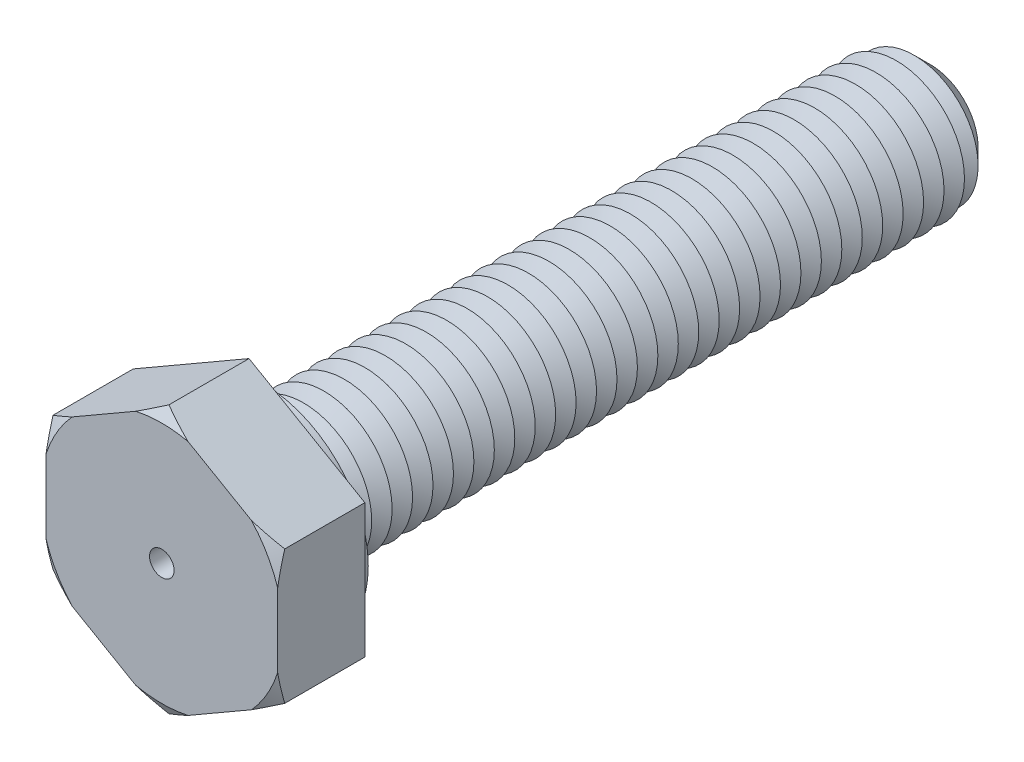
ISO-10303-21;
HEADER;
FILE_DESCRIPTION(('STEP AP214'),'2;1');
FILE_NAME('part.step','',(''),(''),'','','');
FILE_SCHEMA(('AUTOMOTIVE_DESIGN { 1 0 10303 214 1 1 1 1 }'));
ENDSEC;
DATA;
#1=APPLICATION_CONTEXT('core data for automotive mechanical design processes');
#2=APPLICATION_PROTOCOL_DEFINITION('international standard','automotive_design',2000,#1);
#3=PRODUCT_CONTEXT('',#1,'mechanical');
#4=PRODUCT('Part','Part','',(#3));
#5=PRODUCT_RELATED_PRODUCT_CATEGORY('part','',(#4));
#6=PRODUCT_DEFINITION_FORMATION('','',#4);
#7=PRODUCT_DEFINITION_CONTEXT('part definition',#1,'design');
#8=PRODUCT_DEFINITION('design','',#6,#7);
#9=PRODUCT_DEFINITION_SHAPE('','',#8);
#10=(LENGTH_UNIT() NAMED_UNIT(*) SI_UNIT(.MILLI.,.METRE.));
#11=(NAMED_UNIT(*) PLANE_ANGLE_UNIT() SI_UNIT($,.RADIAN.));
#12=(NAMED_UNIT(*) SI_UNIT($,.STERADIAN.) SOLID_ANGLE_UNIT());
#13=UNCERTAINTY_MEASURE_WITH_UNIT(LENGTH_MEASURE(1.E-05),#10,'distance_accuracy_value','');
#14=(GEOMETRIC_REPRESENTATION_CONTEXT(3) GLOBAL_UNCERTAINTY_ASSIGNED_CONTEXT((#13)) GLOBAL_UNIT_ASSIGNED_CONTEXT((#10,
#11,#12)) REPRESENTATION_CONTEXT('',''));
#15=CARTESIAN_POINT('',(0.,0.,0.));
#16=DIRECTION('',(0.,0.,1.));
#17=DIRECTION('',(1.,0.,0.));
#18=AXIS2_PLACEMENT_3D('',#15,#16,#17);
#19=CARTESIAN_POINT('',(8.5,4.90747728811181,6.4));
#20=DIRECTION('',(-0.5,-0.866025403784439,0.));
#21=DIRECTION('',(0.866025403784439,-0.5,0.));
#22=AXIS2_PLACEMENT_3D('',#19,#20,#21);
#23=PLANE('',#22);
#24=CARTESIAN_POINT('',(14.3974196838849,1.50260044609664,3.18954977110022));
#25=CARTESIAN_POINT('',(14.1303849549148,1.65677301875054,3.33361874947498));
#26=CARTESIAN_POINT('',(13.8627107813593,1.81131477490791,3.47613168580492));
#27=CARTESIAN_POINT('',(13.3258139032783,2.12129233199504,3.75731467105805));
#28=CARTESIAN_POINT('',(13.0565910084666,2.27672824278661,3.89598423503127));
#29=CARTESIAN_POINT('',(12.5155257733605,2.58911240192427,4.16915145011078));
#30=CARTESIAN_POINT('',(12.2436777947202,2.74606390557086,4.30363425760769));
#31=CARTESIAN_POINT('',(11.697943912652,3.06114350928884,4.56695627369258));
#32=CARTESIAN_POINT('',(11.4240580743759,3.21927157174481,4.69579566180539));
#33=CARTESIAN_POINT('',(10.8669438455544,3.54092162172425,4.94977636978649));
#34=CARTESIAN_POINT('',(10.5836547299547,3.70447866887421,5.07474091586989));
#35=CARTESIAN_POINT('',(10.0142178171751,4.03324322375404,5.31575754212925));
#36=CARTESIAN_POINT('',(9.72806988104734,4.19845081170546,5.43180918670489));
#37=CARTESIAN_POINT('',(9.15284957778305,4.53055440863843,5.6527883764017));
#38=CARTESIAN_POINT('',(8.86378033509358,4.69744861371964,5.75772666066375));
#39=CARTESIAN_POINT('',(8.28224800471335,5.03319646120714,5.95405449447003));
#40=CARTESIAN_POINT('',(7.98978536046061,5.20204984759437,6.04544579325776));
#41=CARTESIAN_POINT('',(7.29029341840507,5.60590170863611,6.24311258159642));
#42=CARTESIAN_POINT('',(6.88163396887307,5.84184135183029,6.34201308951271));
#43=CARTESIAN_POINT('',(6.2644717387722,6.1981601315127,6.46082851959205));
#44=CARTESIAN_POINT('',(6.05806549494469,6.31732883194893,6.49551015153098));
#45=CARTESIAN_POINT('',(5.64409758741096,6.55633331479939,6.55416143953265));
#46=CARTESIAN_POINT('',(5.43653593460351,6.67616909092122,6.57813119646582));
#47=CARTESIAN_POINT('',(5.02306823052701,6.914884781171,6.6144556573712));
#48=CARTESIAN_POINT('',(4.81717088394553,7.03375966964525,6.62694180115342));
#49=CARTESIAN_POINT('',(4.40509314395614,7.27167286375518,6.64040244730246));
#50=CARTESIAN_POINT('',(4.19891275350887,7.39071116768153,6.64137706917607));
#51=CARTESIAN_POINT('',(3.78675559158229,7.62867021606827,6.63178359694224));
#52=CARTESIAN_POINT('',(3.58077881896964,7.747590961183,6.62121556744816));
#53=CARTESIAN_POINT('',(3.16946579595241,7.9850626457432,6.58885652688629));
#54=CARTESIAN_POINT('',(2.96412965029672,8.10361352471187,6.56706376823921));
#55=CARTESIAN_POINT('',(2.47890311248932,8.38375919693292,6.50285520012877));
#56=CARTESIAN_POINT('',(2.19947000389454,8.54508997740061,6.45579627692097));
#57=CARTESIAN_POINT('',(1.6432817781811,8.86620539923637,6.34397240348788));
#58=CARTESIAN_POINT('',(1.36652705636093,9.02598981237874,6.27920487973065));
#59=CARTESIAN_POINT('',(0.815728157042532,9.34399370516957,6.13440902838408));
#60=CARTESIAN_POINT('',(0.541687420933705,9.50221119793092,6.05436342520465));
#61=CARTESIAN_POINT('',(-0.00331670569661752,9.81686947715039,5.88153285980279));
#62=CARTESIAN_POINT('',(-0.274280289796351,9.97331037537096,5.788748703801));
#63=CARTESIAN_POINT('',(-0.816522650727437,10.2863741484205,5.59147835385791));
#64=CARTESIAN_POINT('',(-1.08776675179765,10.4429770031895,5.48686595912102));
#65=CARTESIAN_POINT('',(-1.62738149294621,10.7545237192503,5.26886764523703));
#66=CARTESIAN_POINT('',(-1.89575390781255,10.9094686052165,5.15548754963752));
#67=CARTESIAN_POINT('',(-2.43005320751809,11.2179464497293,4.92150983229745));
#68=CARTESIAN_POINT('',(-2.69598059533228,11.3714796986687,4.80091373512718));
#69=CARTESIAN_POINT('',(-3.22575115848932,11.6773428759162,4.55376737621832));
#70=CARTESIAN_POINT('',(-3.48959429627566,11.829672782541,4.42721700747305));
#71=CARTESIAN_POINT('',(-3.9337259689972,12.0860923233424,4.20929972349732));
#72=CARTESIAN_POINT('',(-4.11449197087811,12.1904576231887,4.11922480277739));
#73=CARTESIAN_POINT('',(-4.47523725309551,12.3987340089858,3.93701701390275));
#74=CARTESIAN_POINT('',(-4.6552165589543,12.5026451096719,3.84488421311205));
#75=CARTESIAN_POINT('',(-5.01258669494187,12.7089728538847,3.65977671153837));
#76=CARTESIAN_POINT('',(-5.18998489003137,12.8113937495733,3.56682094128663));
#77=CARTESIAN_POINT('',(-5.54415606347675,13.0158745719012,3.3793246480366));
#78=CARTESIAN_POINT('',(-5.72092903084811,13.1179344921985,3.28478409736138));
#79=CARTESIAN_POINT('',(-5.89741968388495,13.2198314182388,3.18954977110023));
#80=B_SPLINE_CURVE_WITH_KNOTS('',3,(#24,#25,#26,#27,#28,#29,#30,#31,#32,#33,#34,#35,#36,#37,#38,
#39,#40,#41,#42,#43,#44,#45,#46,#47,#48,#49,#50,#51,#52,#53,#54,#55,#56,#57,#58,#59,#60,#61,#62,
#63,#64,#65,#66,#67,#68,#69,#70,#71,#72,#73,#74,#75,#76,#77,#78,#79),.UNSPECIFIED.,.F.,.F.,(4,2,
2,2,2,2,2,2,2,2,2,2,2,2,2,2,2,2,2,2,2,2,2,2,2,2,2,4),(0.,1.02103660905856,2.04220146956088,
3.06664888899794,4.09106369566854,5.1414707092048,6.19192902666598,7.24136281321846,
8.29066097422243,9.73548564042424,10.45782862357,11.1801648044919,11.8941264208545,
12.6080806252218,13.3220308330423,14.036092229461,15.0137259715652,15.9915018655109,
16.9703899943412,17.9492161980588,18.939699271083,19.9295300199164,20.9191523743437,
21.9087925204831,22.5907917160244,23.272768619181,23.947601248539,24.622445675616),.UNSPECIFIED.);
#81=CARTESIAN_POINT('',(8.5,4.90747728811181,5.88038475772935));
#82=VERTEX_POINT('',#81);
#83=CARTESIAN_POINT('',(6.57804882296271,6.01711631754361,6.4));
#84=VERTEX_POINT('',#83);
#85=EDGE_CURVE('E132',#82,#84,#80,.T.);
#86=ORIENTED_EDGE('',*,*,#85,.F.);
#87=DIRECTION('',(0.,0.,-1.));
#88=VECTOR('',#87,1.);
#89=CARTESIAN_POINT('',(8.5,4.90747728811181,6.4));
#90=LINE('',#89,#88);
#91=CARTESIAN_POINT('',(8.5,4.90747728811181,0.));
#92=VERTEX_POINT('',#91);
#93=EDGE_CURVE('E144',#82,#92,#90,.T.);
#94=ORIENTED_EDGE('',*,*,#93,.T.);
#95=DIRECTION('',(-0.866025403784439,0.5,0.));
#96=VECTOR('',#95,1.);
#97=CARTESIAN_POINT('',(8.5,4.90747728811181,0.));
#98=LINE('',#97,#96);
#99=CARTESIAN_POINT('',(0.,9.81495457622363,0.));
#100=VERTEX_POINT('',#99);
#101=EDGE_CURVE('E458',#92,#100,#98,.T.);
#102=ORIENTED_EDGE('',*,*,#101,.T.);
#103=DIRECTION('',(0.,0.,-1.));
#104=VECTOR('',#103,1.);
#105=CARTESIAN_POINT('',(0.,9.81495457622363,6.4));
#106=LINE('',#105,#104);
#107=CARTESIAN_POINT('',(0.,9.81495457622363,5.88038475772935));
#108=VERTEX_POINT('',#107);
#109=EDGE_CURVE('E179',#108,#100,#106,.T.);
#110=ORIENTED_EDGE('',*,*,#109,.F.);
#111=CARTESIAN_POINT('',(1.92195117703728,8.70531554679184,6.4));
#112=VERTEX_POINT('',#111);
#113=EDGE_CURVE('E151',#112,#108,#80,.T.);
#114=ORIENTED_EDGE('',*,*,#113,.F.);
#115=DIRECTION('',(-0.866025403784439,0.5,0.));
#116=VECTOR('',#115,1.);
#117=CARTESIAN_POINT('',(8.5,4.90747728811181,6.4));
#118=LINE('',#117,#116);
#119=EDGE_CURVE('E148',#84,#112,#118,.T.);
#120=ORIENTED_EDGE('',*,*,#119,.F.);
#121=EDGE_LOOP('',(#86,#94,#102,#110,#114,#120));
#122=FACE_BOUND('',#121,.T.);
#123=ADVANCED_FACE('F39',(#122),#23,.F.);
#124=CARTESIAN_POINT('',(0.,9.81495457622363,6.4));
#125=DIRECTION('',(0.5,-0.866025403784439,0.));
#126=DIRECTION('',(0.866025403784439,0.5,0.));
#127=AXIS2_PLACEMENT_3D('',#124,#125,#126);
#128=PLANE('',#127);
#129=CARTESIAN_POINT('',(5.89741968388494,13.2198314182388,3.18954977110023));
#130=CARTESIAN_POINT('',(5.63038495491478,13.0656588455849,3.33361874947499));
#131=CARTESIAN_POINT('',(5.36271078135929,12.9111170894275,3.47613168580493));
#132=CARTESIAN_POINT('',(4.82581390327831,12.6011395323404,3.75731467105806));
#133=CARTESIAN_POINT('',(4.55659100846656,12.4457036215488,3.89598423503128));
#134=CARTESIAN_POINT('',(4.01552577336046,12.1333194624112,4.16915145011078));
#135=CARTESIAN_POINT('',(3.74367779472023,11.9763679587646,4.30363425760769));
#136=CARTESIAN_POINT('',(3.19794391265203,11.6612883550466,4.56695627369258));
#137=CARTESIAN_POINT('',(2.92405807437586,11.5031602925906,4.69579566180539));
#138=CARTESIAN_POINT('',(2.3669438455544,11.1815102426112,4.9497763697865));
#139=CARTESIAN_POINT('',(2.08365472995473,11.0179531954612,5.0747409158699));
#140=CARTESIAN_POINT('',(1.51421781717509,10.6891886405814,5.31575754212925));
#141=CARTESIAN_POINT('',(1.22806988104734,10.52398105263,5.4318091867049));
#142=CARTESIAN_POINT('',(0.652849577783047,10.191877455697,5.6527883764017));
#143=CARTESIAN_POINT('',(0.363780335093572,10.0249832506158,5.75772666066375));
#144=CARTESIAN_POINT('',(-0.21775199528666,9.6892354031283,5.95405449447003));
#145=CARTESIAN_POINT('',(-0.510214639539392,9.52038201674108,6.04544579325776));
#146=CARTESIAN_POINT('',(-1.20970658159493,9.11653015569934,6.24311258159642));
#147=CARTESIAN_POINT('',(-1.61836603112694,8.88059051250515,6.34201308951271));
#148=CARTESIAN_POINT('',(-2.2355282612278,8.52427173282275,6.46082851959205));
#149=CARTESIAN_POINT('',(-2.44193450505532,8.40510303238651,6.49551015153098));
#150=CARTESIAN_POINT('',(-2.85590241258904,8.16609854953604,6.55416143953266));
#151=CARTESIAN_POINT('',(-3.0634640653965,8.04626277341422,6.57813119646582));
#152=CARTESIAN_POINT('',(-3.47693176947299,7.80754708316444,6.6144556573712));
#153=CARTESIAN_POINT('',(-3.68282911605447,7.68867219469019,6.62694180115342));
#154=CARTESIAN_POINT('',(-4.09490685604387,7.45075900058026,6.64040244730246));
#155=CARTESIAN_POINT('',(-4.30108724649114,7.33172069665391,6.64137706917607));
#156=CARTESIAN_POINT('',(-4.71324440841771,7.09376164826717,6.63178359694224));
#157=CARTESIAN_POINT('',(-4.91922118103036,6.97484090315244,6.62121556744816));
#158=CARTESIAN_POINT('',(-5.3305342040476,6.73736921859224,6.58885652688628));
#159=CARTESIAN_POINT('',(-5.53587034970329,6.61881833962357,6.5670637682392));
#160=CARTESIAN_POINT('',(-6.02109688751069,6.33867266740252,6.50285520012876));
#161=CARTESIAN_POINT('',(-6.30052999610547,6.17734188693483,6.45579627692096));
#162=CARTESIAN_POINT('',(-6.85671822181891,5.85622646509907,6.34397240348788));
#163=CARTESIAN_POINT('',(-7.13347294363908,5.6964420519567,6.27920487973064));
#164=CARTESIAN_POINT('',(-7.68427184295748,5.37843815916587,6.13440902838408));
#165=CARTESIAN_POINT('',(-7.9583125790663,5.22022066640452,6.05436342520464));
#166=CARTESIAN_POINT('',(-8.50331670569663,4.90556238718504,5.88153285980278));
#167=CARTESIAN_POINT('',(-8.77428028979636,4.74912148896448,5.78874870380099));
#168=CARTESIAN_POINT('',(-9.31652265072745,4.4360577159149,5.59147835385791));
#169=CARTESIAN_POINT('',(-9.58776675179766,4.27945486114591,5.48686595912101));
#170=CARTESIAN_POINT('',(-10.1273814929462,3.9679081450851,5.26886764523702));
#171=CARTESIAN_POINT('',(-10.3957539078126,3.81296325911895,5.15548754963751));
#172=CARTESIAN_POINT('',(-10.9300532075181,3.50448541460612,4.92150983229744));
#173=CARTESIAN_POINT('',(-11.1959805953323,3.35095216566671,4.80091373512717));
#174=CARTESIAN_POINT('',(-11.7257511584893,3.04508898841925,4.55376737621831));
#175=CARTESIAN_POINT('',(-11.9895942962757,2.89275908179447,4.42721700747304));
#176=CARTESIAN_POINT('',(-12.4337259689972,2.63633954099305,4.20929972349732));
#177=CARTESIAN_POINT('',(-12.6144919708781,2.53197424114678,4.11922480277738));
#178=CARTESIAN_POINT('',(-12.9752372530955,2.32369785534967,3.93701701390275));
#179=CARTESIAN_POINT('',(-13.1552165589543,2.21978675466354,3.84488421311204));
#180=CARTESIAN_POINT('',(-13.5125866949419,2.01345901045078,3.65977671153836));
#181=CARTESIAN_POINT('',(-13.6899848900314,1.91103811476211,3.56682094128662));
#182=CARTESIAN_POINT('',(-14.0441560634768,1.70655729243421,3.37932464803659));
#183=CARTESIAN_POINT('',(-14.2209290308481,1.60449737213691,3.28478409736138));
#184=CARTESIAN_POINT('',(-14.3974196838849,1.50260044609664,3.18954977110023));
#185=B_SPLINE_CURVE_WITH_KNOTS('',3,(#129,#130,#131,#132,#133,#134,#135,#136,#137,#138,#139,
#140,#141,#142,#143,#144,#145,#146,#147,#148,#149,#150,#151,#152,#153,#154,#155,#156,#157,#158,
#159,#160,#161,#162,#163,#164,#165,#166,#167,#168,#169,#170,#171,#172,#173,#174,#175,#176,#177,
#178,#179,#180,#181,#182,#183,#184),.UNSPECIFIED.,.F.,.F.,(4,2,2,2,2,2,2,2,2,2,2,2,2,2,2,2,2,2,
2,2,2,2,2,2,2,2,2,4),(0.,1.02103660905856,2.04220146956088,3.06664888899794,4.09106369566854,
5.14147070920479,6.19192902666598,7.24136281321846,8.29066097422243,9.73548564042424,
10.45782862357,11.1801648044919,11.8941264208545,12.6080806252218,13.3220308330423,
14.036092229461,15.0137259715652,15.991501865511,16.9703899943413,17.9492161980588,
18.939699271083,19.9295300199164,20.9191523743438,21.9087925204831,22.5907917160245,
23.272768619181,23.947601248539,24.622445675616),.UNSPECIFIED.);
#186=CARTESIAN_POINT('',(-1.92195117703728,8.70531554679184,6.4));
#187=VERTEX_POINT('',#186);
#188=EDGE_CURVE('E511',#108,#187,#185,.T.);
#189=ORIENTED_EDGE('',*,*,#188,.F.);
#190=ORIENTED_EDGE('',*,*,#109,.T.);
#191=DIRECTION('',(-0.866025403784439,-0.5,0.));
#192=VECTOR('',#191,1.);
#193=CARTESIAN_POINT('',(0.,9.81495457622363,0.));
#194=LINE('',#193,#192);
#195=CARTESIAN_POINT('',(-8.5,4.90747728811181,0.));
#196=VERTEX_POINT('',#195);
#197=EDGE_CURVE('E477',#100,#196,#194,.T.);
#198=ORIENTED_EDGE('',*,*,#197,.T.);
#199=DIRECTION('',(0.,0.,-1.));
#200=VECTOR('',#199,1.);
#201=CARTESIAN_POINT('',(-8.5,4.90747728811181,6.4));
#202=LINE('',#201,#200);
#203=CARTESIAN_POINT('',(-8.5,4.90747728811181,5.88038475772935));
#204=VERTEX_POINT('',#203);
#205=EDGE_CURVE('E176',#204,#196,#202,.T.);
#206=ORIENTED_EDGE('',*,*,#205,.F.);
#207=CARTESIAN_POINT('',(-6.57804882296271,6.01711631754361,6.4));
#208=VERTEX_POINT('',#207);
#209=EDGE_CURVE('E515',#208,#204,#185,.T.);
#210=ORIENTED_EDGE('',*,*,#209,.F.);
#211=DIRECTION('',(-0.866025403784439,-0.5,0.));
#212=VECTOR('',#211,1.);
#213=CARTESIAN_POINT('',(0.,9.81495457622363,6.4));
#214=LINE('',#213,#212);
#215=EDGE_CURVE('E460',#187,#208,#214,.T.);
#216=ORIENTED_EDGE('',*,*,#215,.F.);
#217=EDGE_LOOP('',(#189,#190,#198,#206,#210,#216));
#218=FACE_BOUND('',#217,.T.);
#219=ADVANCED_FACE('F508',(#218),#128,.F.);
#220=CARTESIAN_POINT('',(-8.5,4.90747728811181,6.4));
#221=DIRECTION('',(1.,0.,0.));
#222=DIRECTION('',(0.,0.,-1.));
#223=AXIS2_PLACEMENT_3D('',#220,#221,#222);
#224=PLANE('',#223);
#225=CARTESIAN_POINT('',(-8.5,10.8048969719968,3.60988571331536));
#226=CARTESIAN_POINT('',(-8.5,10.4978348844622,3.74918346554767));
#227=CARTESIAN_POINT('',(-8.5,10.189932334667,3.88666386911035));
#228=CARTESIAN_POINT('',(-8.5,9.57208629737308,4.15710808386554));
#229=CARTESIAN_POINT('',(-8.5,9.26214245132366,4.29007107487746));
#230=CARTESIAN_POINT('',(-8.5,8.6386633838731,4.55109231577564));
#231=CARTESIAN_POINT('',(-8.5,8.32511856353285,4.67912772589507));
#232=CARTESIAN_POINT('',(-8.5,7.69537699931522,4.92848462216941));
#233=CARTESIAN_POINT('',(-8.5,7.37918037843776,5.04980641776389));
#234=CARTESIAN_POINT('',(-8.5,6.74517674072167,5.28371307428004));
#235=CARTESIAN_POINT('',(-8.5,6.42738342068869,5.39633487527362));
#236=CARTESIAN_POINT('',(-8.5,5.78839893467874,5.61161420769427));
#237=CARTESIAN_POINT('',(-8.5,5.46720760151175,5.7142712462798));
#238=CARTESIAN_POINT('',(-8.5,4.82159629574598,5.90726308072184));
#239=CARTESIAN_POINT('',(-8.5,4.49718135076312,5.99761456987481));
#240=CARTESIAN_POINT('',(-8.5,3.84456693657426,6.16359045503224));
#241=CARTESIAN_POINT('',(-8.5,3.51636763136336,6.23921548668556));
#242=CARTESIAN_POINT('',(-8.5,2.94974096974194,6.35404738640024));
#243=CARTESIAN_POINT('',(-8.5,2.7121746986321,6.39750509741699));
#244=CARTESIAN_POINT('',(-8.5,2.23545236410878,6.47441576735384));
#245=CARTESIAN_POINT('',(-8.5,1.99629657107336,6.50787038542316));
#246=CARTESIAN_POINT('',(-8.5,1.51674855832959,6.56389930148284));
#247=CARTESIAN_POINT('',(-8.5,1.27635657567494,6.58647561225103));
#248=CARTESIAN_POINT('',(-8.5,0.794760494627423,6.62010098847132));
#249=CARTESIAN_POINT('',(-8.5,0.553556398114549,6.63115008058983));
#250=CARTESIAN_POINT('',(-8.5,0.0710159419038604,6.64137634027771));
#251=CARTESIAN_POINT('',(-8.5,-0.170320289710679,6.64055949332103));
#252=CARTESIAN_POINT('',(-8.5,-0.65265778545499,6.62709447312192));
#253=CARTESIAN_POINT('',(-8.5,-0.893659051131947,6.6144463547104));
#254=CARTESIAN_POINT('',(-8.5,-1.37480632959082,6.57770491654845));
#255=CARTESIAN_POINT('',(-8.5,-1.61495224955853,6.55361039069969));
#256=CARTESIAN_POINT('',(-8.5,-2.09391419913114,6.49466927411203));
#257=CARTESIAN_POINT('',(-8.5,-2.33273017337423,6.4598222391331));
#258=CARTESIAN_POINT('',(-8.5,-2.92716537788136,6.36046793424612));
#259=CARTESIAN_POINT('',(-8.5,-3.28176466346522,6.28983043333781));
#260=CARTESIAN_POINT('',(-8.5,-3.98672843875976,6.12983266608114));
#261=CARTESIAN_POINT('',(-8.5,-4.3370917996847,6.0404675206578));
#262=CARTESIAN_POINT('',(-8.5,-5.0342542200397,5.84616571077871));
#263=CARTESIAN_POINT('',(-8.5,-5.3810438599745,5.74119557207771));
#264=CARTESIAN_POINT('',(-8.5,-6.07054103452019,5.51879279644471));
#265=CARTESIAN_POINT('',(-8.5,-6.41324885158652,5.40136102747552));
#266=CARTESIAN_POINT('',(-8.5,-7.09891821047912,5.15508322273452));
#267=CARTESIAN_POINT('',(-8.5,-7.44183833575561,5.02612259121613));
#268=CARTESIAN_POINT('',(-8.5,-8.12447486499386,4.75996128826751));
#269=CARTESIAN_POINT('',(-8.5,-8.46419106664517,4.62276010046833));
#270=CARTESIAN_POINT('',(-8.5,-9.13876623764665,4.34260011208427));
#271=CARTESIAN_POINT('',(-8.5,-9.47364225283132,4.19968216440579));
#272=CARTESIAN_POINT('',(-8.5,-10.1409696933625,3.90850505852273));
#273=CARTESIAN_POINT('',(-8.5,-10.4734216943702,3.76024722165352));
#274=CARTESIAN_POINT('',(-8.5,-10.8048969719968,3.60988571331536));
#275=B_SPLINE_CURVE_WITH_KNOTS('',3,(#225,#226,#227,#228,#229,#230,#231,#232,#233,#234,#235,
#236,#237,#238,#239,#240,#241,#242,#243,#244,#245,#246,#247,#248,#249,#250,#251,#252,#253,#254,
#255,#256,#257,#258,#259,#260,#261,#262,#263,#264,#265,#266,#267,#268,#269,#270,#271,#272,#273,
#274),.UNSPECIFIED.,.F.,.F.,(4,2,2,2,2,2,2,2,2,2,2,2,2,2,2,2,2,2,2,2,2,2,2,2,4),(0.,
1.01155870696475,2.02330010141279,3.03927305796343,4.05519914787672,5.06654285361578,
6.07793655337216,7.08794426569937,8.09790837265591,8.82224854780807,9.5464685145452,
10.2705544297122,10.9946386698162,11.7183576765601,12.4420733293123,13.1658652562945,
13.8896870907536,14.9737367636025,16.0580692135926,17.1447621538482,18.2313794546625,
19.3303511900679,20.4293918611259,21.5216359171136,22.6136115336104),.UNSPECIFIED.);
#276=CARTESIAN_POINT('',(-8.5,2.68819922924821,6.4));
#277=VERTEX_POINT('',#276);
#278=EDGE_CURVE('E518',#204,#277,#275,.T.);
#279=ORIENTED_EDGE('',*,*,#278,.F.);
#280=ORIENTED_EDGE('',*,*,#205,.T.);
#281=DIRECTION('',(0.,-1.,0.));
#282=VECTOR('',#281,1.);
#283=CARTESIAN_POINT('',(-8.5,4.90747728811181,0.));
#284=LINE('',#283,#282);
#285=CARTESIAN_POINT('',(-8.5,-4.90747728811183,0.));
#286=VERTEX_POINT('',#285);
#287=EDGE_CURVE('E481',#196,#286,#284,.T.);
#288=ORIENTED_EDGE('',*,*,#287,.T.);
#289=DIRECTION('',(0.,0.,-1.));
#290=VECTOR('',#289,1.);
#291=CARTESIAN_POINT('',(-8.5,-4.90747728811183,6.4));
#292=LINE('',#291,#290);
#293=CARTESIAN_POINT('',(-8.49999999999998,-4.90747728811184,5.88038475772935));
#294=VERTEX_POINT('',#293);
#295=EDGE_CURVE('E173',#294,#286,#292,.T.);
#296=ORIENTED_EDGE('',*,*,#295,.F.);
#297=CARTESIAN_POINT('',(-8.5,-2.68819922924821,6.4));
#298=VERTEX_POINT('',#297);
#299=EDGE_CURVE('E525',#298,#294,#275,.T.);
#300=ORIENTED_EDGE('',*,*,#299,.F.);
#301=DIRECTION('',(0.,-1.,0.));
#302=VECTOR('',#301,1.);
#303=CARTESIAN_POINT('',(-8.5,4.90747728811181,6.4));
#304=LINE('',#303,#302);
#305=EDGE_CURVE('E464',#277,#298,#304,.T.);
#306=ORIENTED_EDGE('',*,*,#305,.F.);
#307=EDGE_LOOP('',(#279,#280,#288,#296,#300,#306));
#308=FACE_BOUND('',#307,.T.);
#309=ADVANCED_FACE('F570',(#308),#224,.F.);
#310=CARTESIAN_POINT('',(-8.5,-4.90747728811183,6.4));
#311=DIRECTION('',(0.5,0.866025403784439,0.));
#312=DIRECTION('',(-0.866025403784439,0.5,0.));
#313=AXIS2_PLACEMENT_3D('',#310,#311,#312);
#314=PLANE('',#313);
#315=CARTESIAN_POINT('',(-14.3974196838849,-1.50260044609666,3.18954977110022));
#316=CARTESIAN_POINT('',(-14.1303849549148,-1.65677301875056,3.33361874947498));
#317=CARTESIAN_POINT('',(-13.8627107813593,-1.81131477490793,3.47613168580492));
#318=CARTESIAN_POINT('',(-13.3258139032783,-2.12129233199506,3.75731467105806));
#319=CARTESIAN_POINT('',(-13.0565910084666,-2.27672824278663,3.89598423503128));
#320=CARTESIAN_POINT('',(-12.5155257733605,-2.58911240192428,4.16915145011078));
#321=CARTESIAN_POINT('',(-12.2436777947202,-2.74606390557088,4.30363425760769));
#322=CARTESIAN_POINT('',(-11.697943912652,-3.06114350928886,4.56695627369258));
#323=CARTESIAN_POINT('',(-11.4240580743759,-3.21927157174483,4.69579566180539));
#324=CARTESIAN_POINT('',(-10.8669438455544,-3.54092162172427,4.94977636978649));
#325=CARTESIAN_POINT('',(-10.5836547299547,-3.70447866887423,5.07474091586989));
#326=CARTESIAN_POINT('',(-10.0142178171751,-4.03324322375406,5.31575754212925));
#327=CARTESIAN_POINT('',(-9.72806988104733,-4.19845081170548,5.43180918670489));
#328=CARTESIAN_POINT('',(-9.15284957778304,-4.53055440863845,5.65278837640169));
#329=CARTESIAN_POINT('',(-8.86378033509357,-4.69744861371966,5.75772666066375));
#330=CARTESIAN_POINT('',(-8.28224800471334,-5.03319646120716,5.95405449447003));
#331=CARTESIAN_POINT('',(-7.9897853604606,-5.20204984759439,6.04544579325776));
#332=CARTESIAN_POINT('',(-7.29029341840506,-5.60590170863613,6.24311258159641));
#333=CARTESIAN_POINT('',(-6.88163396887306,-5.84184135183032,6.34201308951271));
#334=CARTESIAN_POINT('',(-6.26447173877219,-6.19816013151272,6.46082851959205));
#335=CARTESIAN_POINT('',(-6.05806549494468,-6.31732883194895,6.49551015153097));
#336=CARTESIAN_POINT('',(-5.64409758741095,-6.55633331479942,6.55416143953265));
#337=CARTESIAN_POINT('',(-5.4365359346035,-6.67616909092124,6.57813119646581));
#338=CARTESIAN_POINT('',(-5.023068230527,-6.91488478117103,6.6144556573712));
#339=CARTESIAN_POINT('',(-4.81717088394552,-7.03375966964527,6.62694180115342));
#340=CARTESIAN_POINT('',(-4.40509314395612,-7.2716728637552,6.64040244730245));
#341=CARTESIAN_POINT('',(-4.19891275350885,-7.39071116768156,6.64137706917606));
#342=CARTESIAN_POINT('',(-3.78675559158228,-7.6286702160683,6.63178359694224));
#343=CARTESIAN_POINT('',(-3.58077881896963,-7.74759096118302,6.62121556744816));
#344=CARTESIAN_POINT('',(-3.16946579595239,-7.98506264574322,6.58885652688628));
#345=CARTESIAN_POINT('',(-2.9641296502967,-8.10361352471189,6.5670637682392));
#346=CARTESIAN_POINT('',(-2.4789031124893,-8.38375919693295,6.50285520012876));
#347=CARTESIAN_POINT('',(-2.19947000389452,-8.54508997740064,6.45579627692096));
#348=CARTESIAN_POINT('',(-1.64328177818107,-8.8662053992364,6.34397240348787));
#349=CARTESIAN_POINT('',(-1.36652705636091,-9.02598981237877,6.27920487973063));
#350=CARTESIAN_POINT('',(-0.815728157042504,-9.3439937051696,6.13440902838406));
#351=CARTESIAN_POINT('',(-0.541687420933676,-9.50221119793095,6.05436342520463));
#352=CARTESIAN_POINT('',(0.00331670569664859,-9.81686947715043,5.88153285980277));
#353=CARTESIAN_POINT('',(0.274280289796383,-9.973310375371,5.78874870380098));
#354=CARTESIAN_POINT('',(0.81652265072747,-10.2863741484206,5.59147835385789));
#355=CARTESIAN_POINT('',(1.08776675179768,-10.4429770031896,5.486865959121));
#356=CARTESIAN_POINT('',(1.62738149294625,-10.7545237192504,5.268867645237));
#357=CARTESIAN_POINT('',(1.89575390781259,-10.9094686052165,5.15548754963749));
#358=CARTESIAN_POINT('',(2.43005320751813,-11.2179464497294,4.92150983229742));
#359=CARTESIAN_POINT('',(2.69598059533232,-11.3714796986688,4.80091373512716));
#360=CARTESIAN_POINT('',(3.22575115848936,-11.6773428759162,4.55376737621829));
#361=CARTESIAN_POINT('',(3.48959429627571,-11.829672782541,4.42721700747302));
#362=CARTESIAN_POINT('',(3.93372596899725,-12.0860923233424,4.20929972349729));
#363=CARTESIAN_POINT('',(4.11449197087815,-12.1904576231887,4.11922480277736));
#364=CARTESIAN_POINT('',(4.47523725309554,-12.3987340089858,3.93701701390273));
#365=CARTESIAN_POINT('',(4.65521655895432,-12.5026451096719,3.84488421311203));
#366=CARTESIAN_POINT('',(5.01258669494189,-12.7089728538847,3.65977671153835));
#367=CARTESIAN_POINT('',(5.18998489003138,-12.8113937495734,3.56682094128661));
#368=CARTESIAN_POINT('',(5.54415606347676,-13.0158745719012,3.37932464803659));
#369=CARTESIAN_POINT('',(5.72092903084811,-13.1179344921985,3.28478409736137));
#370=CARTESIAN_POINT('',(5.89741968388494,-13.2198314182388,3.18954977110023));
#371=B_SPLINE_CURVE_WITH_KNOTS('',3,(#315,#316,#317,#318,#319,#320,#321,#322,#323,#324,#325,
#326,#327,#328,#329,#330,#331,#332,#333,#334,#335,#336,#337,#338,#339,#340,#341,#342,#343,#344,
#345,#346,#347,#348,#349,#350,#351,#352,#353,#354,#355,#356,#357,#358,#359,#360,#361,#362,#363,
#364,#365,#366,#367,#368,#369,#370),.UNSPECIFIED.,.F.,.F.,(4,2,2,2,2,2,2,2,2,2,2,2,2,2,2,2,2,2,
2,2,2,2,2,2,2,2,2,4),(0.,1.02103660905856,2.04220146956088,3.06664888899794,4.09106369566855,
5.1414707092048,6.19192902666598,7.24136281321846,8.29066097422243,9.73548564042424,
10.45782862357,11.1801648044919,11.8941264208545,12.6080806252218,13.3220308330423,
14.036092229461,15.0137259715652,15.991501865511,16.9703899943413,17.9492161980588,
18.939699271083,19.9295300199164,20.9191523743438,21.9087925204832,22.5907917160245,
23.272768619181,23.947601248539,24.622445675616),.UNSPECIFIED.);
#372=CARTESIAN_POINT('',(-6.57804882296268,-6.01711631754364,6.4));
#373=VERTEX_POINT('',#372);
#374=EDGE_CURVE('E566',#294,#373,#371,.T.);
#375=ORIENTED_EDGE('',*,*,#374,.F.);
#376=ORIENTED_EDGE('',*,*,#295,.T.);
#377=DIRECTION('',(0.866025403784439,-0.5,0.));
#378=VECTOR('',#377,1.);
#379=CARTESIAN_POINT('',(-8.5,-4.90747728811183,0.));
#380=LINE('',#379,#378);
#381=CARTESIAN_POINT('',(0.,-9.81495457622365,0.));
#382=VERTEX_POINT('',#381);
#383=EDGE_CURVE('E485',#286,#382,#380,.T.);
#384=ORIENTED_EDGE('',*,*,#383,.T.);
#385=DIRECTION('',(0.,0.,-1.));
#386=VECTOR('',#385,1.);
#387=CARTESIAN_POINT('',(0.,-9.81495457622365,6.4));
#388=LINE('',#387,#386);
#389=CARTESIAN_POINT('',(0.,-9.81495457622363,5.88038475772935));
#390=VERTEX_POINT('',#389);
#391=EDGE_CURVE('E163',#390,#382,#388,.T.);
#392=ORIENTED_EDGE('',*,*,#391,.F.);
#393=CARTESIAN_POINT('',(-1.92195117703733,-8.70531554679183,6.4));
#394=VERTEX_POINT('',#393);
#395=EDGE_CURVE('E560',#394,#390,#371,.T.);
#396=ORIENTED_EDGE('',*,*,#395,.F.);
#397=DIRECTION('',(0.866025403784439,-0.5,0.));
#398=VECTOR('',#397,1.);
#399=CARTESIAN_POINT('',(-8.5,-4.90747728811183,6.4));
#400=LINE('',#399,#398);
#401=EDGE_CURVE('E468',#373,#394,#400,.T.);
#402=ORIENTED_EDGE('',*,*,#401,.F.);
#403=EDGE_LOOP('',(#375,#376,#384,#392,#396,#402));
#404=FACE_BOUND('',#403,.T.);
#405=ADVANCED_FACE('F567',(#404),#314,.F.);
#406=CARTESIAN_POINT('',(0.,-9.81495457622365,6.4));
#407=DIRECTION('',(-0.5,0.866025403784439,0.));
#408=DIRECTION('',(-0.866025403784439,-0.5,0.));
#409=AXIS2_PLACEMENT_3D('',#406,#407,#408);
#410=PLANE('',#409);
#411=CARTESIAN_POINT('',(-5.89741968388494,-13.2198314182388,3.18954977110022));
#412=CARTESIAN_POINT('',(-5.63038495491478,-13.0656588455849,3.33361874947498));
#413=CARTESIAN_POINT('',(-5.36271078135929,-12.9111170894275,3.47613168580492));
#414=CARTESIAN_POINT('',(-4.8258139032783,-12.6011395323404,3.75731467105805));
#415=CARTESIAN_POINT('',(-4.55659100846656,-12.4457036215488,3.89598423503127));
#416=CARTESIAN_POINT('',(-4.01552577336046,-12.1333194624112,4.16915145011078));
#417=CARTESIAN_POINT('',(-3.74367779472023,-11.9763679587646,4.30363425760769));
#418=CARTESIAN_POINT('',(-3.19794391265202,-11.6612883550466,4.56695627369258));
#419=CARTESIAN_POINT('',(-2.92405807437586,-11.5031602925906,4.69579566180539));
#420=CARTESIAN_POINT('',(-2.36694384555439,-11.1815102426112,4.94977636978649));
#421=CARTESIAN_POINT('',(-2.08365472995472,-11.0179531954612,5.07474091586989));
#422=CARTESIAN_POINT('',(-1.51421781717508,-10.6891886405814,5.31575754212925));
#423=CARTESIAN_POINT('',(-1.22806988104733,-10.52398105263,5.43180918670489));
#424=CARTESIAN_POINT('',(-0.652849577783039,-10.191877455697,5.65278837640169));
#425=CARTESIAN_POINT('',(-0.363780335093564,-10.0249832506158,5.75772666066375));
#426=CARTESIAN_POINT('',(0.217751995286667,-9.68923540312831,5.95405449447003));
#427=CARTESIAN_POINT('',(0.5102146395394,-9.52038201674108,6.04544579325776));
#428=CARTESIAN_POINT('',(1.20970658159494,-9.11653015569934,6.24311258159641));
#429=CARTESIAN_POINT('',(1.61836603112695,-8.88059051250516,6.34201308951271));
#430=CARTESIAN_POINT('',(2.23552826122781,-8.52427173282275,6.46082851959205));
#431=CARTESIAN_POINT('',(2.44193450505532,-8.40510303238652,6.49551015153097));
#432=CARTESIAN_POINT('',(2.85590241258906,-8.16609854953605,6.55416143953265));
#433=CARTESIAN_POINT('',(3.06346406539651,-8.04626277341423,6.57813119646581));
#434=CARTESIAN_POINT('',(3.47693176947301,-7.80754708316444,6.61445565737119));
#435=CARTESIAN_POINT('',(3.68282911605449,-7.6886721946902,6.62694180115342));
#436=CARTESIAN_POINT('',(4.09490685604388,-7.45075900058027,6.64040244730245));
#437=CARTESIAN_POINT('',(4.30108724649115,-7.33172069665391,6.64137706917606));
#438=CARTESIAN_POINT('',(4.71324440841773,-7.09376164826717,6.63178359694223));
#439=CARTESIAN_POINT('',(4.91922118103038,-6.97484090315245,6.62121556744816));
#440=CARTESIAN_POINT('',(5.33053420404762,-6.73736921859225,6.58885652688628));
#441=CARTESIAN_POINT('',(5.5358703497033,-6.61881833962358,6.5670637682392));
#442=CARTESIAN_POINT('',(6.02109688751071,-6.33867266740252,6.50285520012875));
#443=CARTESIAN_POINT('',(6.30052999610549,-6.17734188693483,6.45579627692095));
#444=CARTESIAN_POINT('',(6.85671822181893,-5.85622646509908,6.34397240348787));
#445=CARTESIAN_POINT('',(7.1334729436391,-5.6964420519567,6.27920487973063));
#446=CARTESIAN_POINT('',(7.6842718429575,-5.37843815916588,6.13440902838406));
#447=CARTESIAN_POINT('',(7.95831257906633,-5.22022066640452,6.05436342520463));
#448=CARTESIAN_POINT('',(8.50331670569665,-4.90556238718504,5.88153285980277));
#449=CARTESIAN_POINT('',(8.77428028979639,-4.74912148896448,5.78874870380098));
#450=CARTESIAN_POINT('',(9.31652265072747,-4.4360577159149,5.59147835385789));
#451=CARTESIAN_POINT('',(9.58776675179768,-4.27945486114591,5.486865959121));
#452=CARTESIAN_POINT('',(10.1273814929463,-3.9679081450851,5.268867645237));
#453=CARTESIAN_POINT('',(10.3957539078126,-3.81296325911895,5.15548754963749));
#454=CARTESIAN_POINT('',(10.9300532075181,-3.50448541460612,4.92150983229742));
#455=CARTESIAN_POINT('',(11.1959805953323,-3.35095216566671,4.80091373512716));
#456=CARTESIAN_POINT('',(11.7257511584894,-3.04508898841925,4.5537673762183));
#457=CARTESIAN_POINT('',(11.9895942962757,-2.89275908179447,4.42721700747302));
#458=CARTESIAN_POINT('',(12.4337259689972,-2.63633954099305,4.20929972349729));
#459=CARTESIAN_POINT('',(12.6144919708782,-2.53197424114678,4.11922480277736));
#460=CARTESIAN_POINT('',(12.9752372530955,-2.32369785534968,3.93701701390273));
#461=CARTESIAN_POINT('',(13.1552165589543,-2.21978675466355,3.84488421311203));
#462=CARTESIAN_POINT('',(13.5125866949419,-2.0134590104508,3.65977671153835));
#463=CARTESIAN_POINT('',(13.6899848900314,-1.91103811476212,3.56682094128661));
#464=CARTESIAN_POINT('',(14.0441560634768,-1.70655729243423,3.37932464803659));
#465=CARTESIAN_POINT('',(14.2209290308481,-1.60449737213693,3.28478409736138));
#466=CARTESIAN_POINT('',(14.3974196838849,-1.50260044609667,3.18954977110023));
#467=B_SPLINE_CURVE_WITH_KNOTS('',3,(#411,#412,#413,#414,#415,#416,#417,#418,#419,#420,#421,
#422,#423,#424,#425,#426,#427,#428,#429,#430,#431,#432,#433,#434,#435,#436,#437,#438,#439,#440,
#441,#442,#443,#444,#445,#446,#447,#448,#449,#450,#451,#452,#453,#454,#455,#456,#457,#458,#459,
#460,#461,#462,#463,#464,#465,#466),.UNSPECIFIED.,.F.,.F.,(4,2,2,2,2,2,2,2,2,2,2,2,2,2,2,2,2,2,
2,2,2,2,2,2,2,2,2,4),(0.,1.02103660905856,2.04220146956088,3.06664888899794,4.09106369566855,
5.1414707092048,6.19192902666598,7.24136281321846,8.29066097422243,9.73548564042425,
10.45782862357,11.1801648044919,11.8941264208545,12.6080806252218,13.3220308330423,
14.036092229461,15.0137259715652,15.991501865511,16.9703899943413,17.9492161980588,
18.939699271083,19.9295300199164,20.9191523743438,21.9087925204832,22.5907917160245,
23.272768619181,23.947601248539,24.622445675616),.UNSPECIFIED.);
#468=CARTESIAN_POINT('',(1.92195117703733,-8.70531554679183,6.4));
#469=VERTEX_POINT('',#468);
#470=EDGE_CURVE('E64',#390,#469,#467,.T.);
#471=ORIENTED_EDGE('',*,*,#470,.F.);
#472=ORIENTED_EDGE('',*,*,#391,.T.);
#473=DIRECTION('',(0.866025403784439,0.5,0.));
#474=VECTOR('',#473,1.);
#475=CARTESIAN_POINT('',(0.,-9.81495457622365,0.));
#476=LINE('',#475,#474);
#477=CARTESIAN_POINT('',(8.5,-4.90747728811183,0.));
#478=VERTEX_POINT('',#477);
#479=EDGE_CURVE('E488',#382,#478,#476,.T.);
#480=ORIENTED_EDGE('',*,*,#479,.T.);
#481=DIRECTION('',(0.,0.,-1.));
#482=VECTOR('',#481,1.);
#483=CARTESIAN_POINT('',(8.5,-4.90747728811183,6.4));
#484=LINE('',#483,#482);
#485=CARTESIAN_POINT('',(8.5,-4.90747728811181,5.88038475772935));
#486=VERTEX_POINT('',#485);
#487=EDGE_CURVE('E157',#486,#478,#484,.T.);
#488=ORIENTED_EDGE('',*,*,#487,.F.);
#489=CARTESIAN_POINT('',(6.57804882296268,-6.01711631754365,6.4));
#490=VERTEX_POINT('',#489);
#491=EDGE_CURVE('E555',#490,#486,#467,.T.);
#492=ORIENTED_EDGE('',*,*,#491,.F.);
#493=DIRECTION('',(0.866025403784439,0.5,0.));
#494=VECTOR('',#493,1.);
#495=CARTESIAN_POINT('',(0.,-9.81495457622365,6.4));
#496=LINE('',#495,#494);
#497=EDGE_CURVE('E166',#469,#490,#496,.T.);
#498=ORIENTED_EDGE('',*,*,#497,.F.);
#499=EDGE_LOOP('',(#471,#472,#480,#488,#492,#498));
#500=FACE_BOUND('',#499,.T.);
#501=ADVANCED_FACE('F497',(#500),#410,.F.);
#502=CARTESIAN_POINT('',(8.5,-4.90747728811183,6.4));
#503=DIRECTION('',(-1.,0.,0.));
#504=DIRECTION('',(0.,0.,1.));
#505=AXIS2_PLACEMENT_3D('',#502,#503,#504);
#506=PLANE('',#505);
#507=CARTESIAN_POINT('',(8.5,-10.8048969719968,3.60988571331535));
#508=CARTESIAN_POINT('',(8.5,-10.4978348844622,3.74918346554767));
#509=CARTESIAN_POINT('',(8.5,-10.189932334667,3.88666386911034));
#510=CARTESIAN_POINT('',(8.5,-9.5720862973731,4.15710808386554));
#511=CARTESIAN_POINT('',(8.5,-9.26214245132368,4.29007107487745));
#512=CARTESIAN_POINT('',(8.5,-8.63866338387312,4.55109231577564));
#513=CARTESIAN_POINT('',(8.5,-8.32511856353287,4.67912772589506));
#514=CARTESIAN_POINT('',(8.5,-7.69537699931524,4.9284846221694));
#515=CARTESIAN_POINT('',(8.5,-7.37918037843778,5.04980641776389));
#516=CARTESIAN_POINT('',(8.5,-6.74517674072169,5.28371307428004));
#517=CARTESIAN_POINT('',(8.5,-6.42738342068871,5.39633487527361));
#518=CARTESIAN_POINT('',(8.5,-5.78839893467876,5.61161420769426));
#519=CARTESIAN_POINT('',(8.5,-5.46720760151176,5.71427124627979));
#520=CARTESIAN_POINT('',(8.5,-4.821596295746,5.90726308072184));
#521=CARTESIAN_POINT('',(8.5,-4.49718135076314,5.99761456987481));
#522=CARTESIAN_POINT('',(8.5,-3.84456693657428,6.16359045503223));
#523=CARTESIAN_POINT('',(8.5,-3.51636763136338,6.23921548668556));
#524=CARTESIAN_POINT('',(8.5,-2.94974096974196,6.35404738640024));
#525=CARTESIAN_POINT('',(8.5,-2.71217469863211,6.39750509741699));
#526=CARTESIAN_POINT('',(8.5,-2.2354523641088,6.47441576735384));
#527=CARTESIAN_POINT('',(8.5,-1.99629657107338,6.50787038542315));
#528=CARTESIAN_POINT('',(8.5,-1.51674855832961,6.56389930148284));
#529=CARTESIAN_POINT('',(8.5,-1.27635657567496,6.58647561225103));
#530=CARTESIAN_POINT('',(8.5,-0.794760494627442,6.62010098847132));
#531=CARTESIAN_POINT('',(8.5,-0.553556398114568,6.63115008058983));
#532=CARTESIAN_POINT('',(8.5,-0.0710159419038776,6.64137634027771));
#533=CARTESIAN_POINT('',(8.5,0.170320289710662,6.64055949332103));
#534=CARTESIAN_POINT('',(8.5,0.652657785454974,6.62709447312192));
#535=CARTESIAN_POINT('',(8.5,0.89365905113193,6.61444635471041));
#536=CARTESIAN_POINT('',(8.5,1.37480632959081,6.57770491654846));
#537=CARTESIAN_POINT('',(8.5,1.61495224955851,6.55361039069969));
#538=CARTESIAN_POINT('',(8.5,2.09391419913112,6.49466927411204));
#539=CARTESIAN_POINT('',(8.5,2.33273017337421,6.45982223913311));
#540=CARTESIAN_POINT('',(8.5,2.92716537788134,6.36046793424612));
#541=CARTESIAN_POINT('',(8.5,3.2817646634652,6.28983043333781));
#542=CARTESIAN_POINT('',(8.5,3.98672843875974,6.12983266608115));
#543=CARTESIAN_POINT('',(8.5,4.33709179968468,6.04046752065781));
#544=CARTESIAN_POINT('',(8.5,5.03425422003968,5.84616571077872));
#545=CARTESIAN_POINT('',(8.5,5.38104385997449,5.74119557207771));
#546=CARTESIAN_POINT('',(8.5,6.07054103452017,5.51879279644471));
#547=CARTESIAN_POINT('',(8.5,6.4132488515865,5.40136102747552));
#548=CARTESIAN_POINT('',(8.5,7.0989182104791,5.15508322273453));
#549=CARTESIAN_POINT('',(8.5,7.4418383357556,5.02612259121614));
#550=CARTESIAN_POINT('',(8.5,8.12447486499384,4.75996128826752));
#551=CARTESIAN_POINT('',(8.5,8.46419106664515,4.62276010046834));
#552=CARTESIAN_POINT('',(8.5,9.13876623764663,4.34260011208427));
#553=CARTESIAN_POINT('',(8.5,9.47364225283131,4.19968216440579));
#554=CARTESIAN_POINT('',(8.5,10.1409696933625,3.90850505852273));
#555=CARTESIAN_POINT('',(8.5,10.4734216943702,3.76024722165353));
#556=CARTESIAN_POINT('',(8.5,10.8048969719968,3.60988571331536));
#557=B_SPLINE_CURVE_WITH_KNOTS('',3,(#507,#508,#509,#510,#511,#512,#513,#514,#515,#516,#517,
#518,#519,#520,#521,#522,#523,#524,#525,#526,#527,#528,#529,#530,#531,#532,#533,#534,#535,#536,
#537,#538,#539,#540,#541,#542,#543,#544,#545,#546,#547,#548,#549,#550,#551,#552,#553,#554,#555,
#556),.UNSPECIFIED.,.F.,.F.,(4,2,2,2,2,2,2,2,2,2,2,2,2,2,2,2,2,2,2,2,2,2,2,2,4),(0.,
1.01155870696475,2.02330010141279,3.03927305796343,4.05519914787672,5.06654285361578,
6.07793655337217,7.08794426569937,8.09790837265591,8.82224854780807,9.5464685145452,
10.2705544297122,10.9946386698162,11.7183576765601,12.4420733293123,13.1658652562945,
13.8896870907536,14.9737367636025,16.0580692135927,17.1447621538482,18.2313794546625,
19.3303511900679,20.4293918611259,21.5216359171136,22.6136115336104),.UNSPECIFIED.);
#558=CARTESIAN_POINT('',(8.5,-2.68819922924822,6.4));
#559=VERTEX_POINT('',#558);
#560=EDGE_CURVE('E56',#486,#559,#557,.T.);
#561=ORIENTED_EDGE('',*,*,#560,.F.);
#562=ORIENTED_EDGE('',*,*,#487,.T.);
#563=DIRECTION('',(0.,1.,0.));
#564=VECTOR('',#563,1.);
#565=CARTESIAN_POINT('',(8.5,-4.90747728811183,0.));
#566=LINE('',#565,#564);
#567=EDGE_CURVE('E154',#478,#92,#566,.T.);
#568=ORIENTED_EDGE('',*,*,#567,.T.);
#569=ORIENTED_EDGE('',*,*,#93,.F.);
#570=CARTESIAN_POINT('',(8.5,2.68819922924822,6.4));
#571=VERTEX_POINT('',#570);
#572=EDGE_CURVE('E129',#571,#82,#557,.T.);
#573=ORIENTED_EDGE('',*,*,#572,.F.);
#574=DIRECTION('',(0.,1.,0.));
#575=VECTOR('',#574,1.);
#576=CARTESIAN_POINT('',(8.5,-4.90747728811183,6.4));
#577=LINE('',#576,#575);
#578=EDGE_CURVE('E158',#559,#571,#577,.T.);
#579=ORIENTED_EDGE('',*,*,#578,.F.);
#580=EDGE_LOOP('',(#561,#562,#568,#569,#573,#579));
#581=FACE_BOUND('',#580,.T.);
#582=ADVANCED_FACE('F152',(#581),#506,.F.);
#583=CARTESIAN_POINT('',(0.,0.,6.4));
#584=DIRECTION('',(0.,0.,1.));
#585=DIRECTION('',(1.,0.,0.));
#586=AXIS2_PLACEMENT_3D('',#583,#584,#585);
#587=PLANE('',#586);
#588=CARTESIAN_POINT('',(0.,0.,6.4));
#589=DIRECTION('',(0.,0.,1.));
#590=DIRECTION('',(1.,0.,0.));
#591=AXIS2_PLACEMENT_3D('',#588,#589,#590);
#592=CIRCLE('',#591,0.9);
#593=CARTESIAN_POINT('',(0.9,0.,6.4));
#594=VERTEX_POINT('',#593);
#595=EDGE_CURVE('E1451',#594,#594,#592,.T.);
#596=ORIENTED_EDGE('',*,*,#595,.F.);
#597=EDGE_LOOP('',(#596));
#598=FACE_BOUND('',#597,.T.);
#599=ORIENTED_EDGE('',*,*,#578,.T.);
#600=CARTESIAN_POINT('',(0.,0.,6.4));
#601=DIRECTION('',(0.,0.,1.));
#602=DIRECTION('',(1.,0.,0.));
#603=AXIS2_PLACEMENT_3D('',#600,#601,#602);
#604=CIRCLE('',#603,8.91495457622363);
#605=EDGE_CURVE('E134',#571,#84,#604,.T.);
#606=ORIENTED_EDGE('',*,*,#605,.T.);
#607=ORIENTED_EDGE('',*,*,#119,.T.);
#608=CARTESIAN_POINT('',(0.,0.,6.4));
#609=DIRECTION('',(0.,0.,1.));
#610=DIRECTION('',(1.,0.,0.));
#611=AXIS2_PLACEMENT_3D('',#608,#609,#610);
#612=CIRCLE('',#611,8.91495457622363);
#613=EDGE_CURVE('E11',#112,#187,#612,.T.);
#614=ORIENTED_EDGE('',*,*,#613,.T.);
#615=ORIENTED_EDGE('',*,*,#215,.T.);
#616=EDGE_CURVE('E49',#208,#277,#612,.T.);
#617=ORIENTED_EDGE('',*,*,#616,.T.);
#618=ORIENTED_EDGE('',*,*,#305,.T.);
#619=EDGE_CURVE('E1463',#298,#373,#612,.T.);
#620=ORIENTED_EDGE('',*,*,#619,.T.);
#621=ORIENTED_EDGE('',*,*,#401,.T.);
#622=EDGE_CURVE('E1462',#394,#469,#612,.T.);
#623=ORIENTED_EDGE('',*,*,#622,.T.);
#624=ORIENTED_EDGE('',*,*,#497,.T.);
#625=EDGE_CURVE('E43',#490,#559,#612,.T.);
#626=ORIENTED_EDGE('',*,*,#625,.T.);
#627=EDGE_LOOP('',(#599,#606,#607,#614,#615,#617,#618,#620,#621,#623,#624,#626));
#628=FACE_BOUND('',#627,.T.);
#629=ADVANCED_FACE('F608',(#598,#628),#587,.T.);
#630=CARTESIAN_POINT('',(0.,0.,0.));
#631=DIRECTION('',(0.,0.,1.));
#632=DIRECTION('',(1.,0.,0.));
#633=AXIS2_PLACEMENT_3D('',#630,#631,#632);
#634=PLANE('',#633);
#635=CARTESIAN_POINT('',(0.,0.,0.));
#636=DIRECTION('',(0.,0.,1.));
#637=DIRECTION('',(1.,0.,0.));
#638=AXIS2_PLACEMENT_3D('',#635,#636,#637);
#639=CIRCLE('',#638,7.75);
#640=CARTESIAN_POINT('',(7.75,0.,0.));
#641=VERTEX_POINT('',#640);
#642=EDGE_CURVE('E182',#641,#641,#639,.F.);
#643=ORIENTED_EDGE('',*,*,#642,.F.);
#644=EDGE_LOOP('',(#643));
#645=FACE_BOUND('',#644,.T.);
#646=ORIENTED_EDGE('',*,*,#101,.F.);
#647=ORIENTED_EDGE('',*,*,#567,.F.);
#648=ORIENTED_EDGE('',*,*,#479,.F.);
#649=ORIENTED_EDGE('',*,*,#383,.F.);
#650=ORIENTED_EDGE('',*,*,#287,.F.);
#651=ORIENTED_EDGE('',*,*,#197,.F.);
#652=EDGE_LOOP('',(#646,#647,#648,#649,#650,#651));
#653=FACE_BOUND('',#652,.T.);
#654=ADVANCED_FACE('F502',(#645,#653),#634,.F.);
#655=CARTESIAN_POINT('',(0.,0.,-1.));
#656=DIRECTION('',(0.,0.,1.));
#657=DIRECTION('',(1.,0.,0.));
#658=AXIS2_PLACEMENT_3D('',#655,#656,#657);
#659=CYLINDRICAL_SURFACE('',#658,7.75);
#660=CARTESIAN_POINT('',(0.,0.,-1.));
#661=DIRECTION('',(0.,0.,-1.));
#662=DIRECTION('',(-1.,0.,0.));
#663=AXIS2_PLACEMENT_3D('',#660,#661,#662);
#664=CIRCLE('',#663,7.75);
#665=CARTESIAN_POINT('',(-7.75,0.,-1.));
#666=VERTEX_POINT('',#665);
#667=EDGE_CURVE('E454',#666,#666,#664,.T.);
#668=ORIENTED_EDGE('',*,*,#667,.F.);
#669=EDGE_LOOP('',(#668));
#670=FACE_BOUND('',#669,.T.);
#671=ORIENTED_EDGE('',*,*,#642,.T.);
#672=EDGE_LOOP('',(#671));
#673=FACE_BOUND('',#672,.T.);
#674=ADVANCED_FACE('F626',(#670,#673),#659,.T.);
#675=CARTESIAN_POINT('',(0.,0.,-1.));
#676=DIRECTION('',(0.,0.,-1.));
#677=DIRECTION('',(-1.,0.,0.));
#678=AXIS2_PLACEMENT_3D('',#675,#676,#677);
#679=PLANE('',#678);
#680=CARTESIAN_POINT('',(0.,0.,-1.));
#681=DIRECTION('',(0.,0.,1.));
#682=DIRECTION('',(1.,0.,0.));
#683=AXIS2_PLACEMENT_3D('',#680,#681,#682);
#684=CIRCLE('',#683,5.);
#685=CARTESIAN_POINT('',(5.,0.,-1.));
#686=VERTEX_POINT('',#685);
#687=EDGE_CURVE('E450',#686,#686,#684,.T.);
#688=ORIENTED_EDGE('',*,*,#687,.T.);
#689=EDGE_LOOP('',(#688));
#690=FACE_BOUND('',#689,.T.);
#691=ORIENTED_EDGE('',*,*,#667,.T.);
#692=EDGE_LOOP('',(#691));
#693=FACE_BOUND('',#692,.T.);
#694=ADVANCED_FACE('F635',(#690,#693),#679,.T.);
#695=CARTESIAN_POINT('',(0.,0.,-1.));
#696=DIRECTION('',(0.,0.,1.));
#697=DIRECTION('',(1.,0.,0.));
#698=AXIS2_PLACEMENT_3D('',#695,#696,#697);
#699=CONICAL_SURFACE('',#698,5.,1.0471975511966);
#700=CARTESIAN_POINT('',(0.,0.,-1.75));
#701=DIRECTION('',(0.,0.,1.));
#702=DIRECTION('',(1.,0.,0.));
#703=AXIS2_PLACEMENT_3D('',#700,#701,#702);
#704=CIRCLE('',#703,3.70096189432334);
#705=CARTESIAN_POINT('',(3.70096189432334,0.,-1.75));
#706=VERTEX_POINT('',#705);
#707=EDGE_CURVE('E446',#706,#706,#704,.T.);
#708=ORIENTED_EDGE('',*,*,#707,.T.);
#709=EDGE_LOOP('',(#708));
#710=FACE_BOUND('',#709,.T.);
#711=ORIENTED_EDGE('',*,*,#687,.F.);
#712=EDGE_LOOP('',(#711));
#713=FACE_BOUND('',#712,.T.);
#714=ADVANCED_FACE('F644',(#710,#713),#699,.T.);
#715=CARTESIAN_POINT('',(0.,0.,-1.75));
#716=DIRECTION('',(0.,0.,-1.));
#717=DIRECTION('',(-1.,0.,0.));
#718=AXIS2_PLACEMENT_3D('',#715,#716,#717);
#719=CONICAL_SURFACE('',#718,3.70096189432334,1.0471975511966);
#720=CARTESIAN_POINT('',(0.,0.,-2.5));
#721=DIRECTION('',(0.,0.,1.));
#722=DIRECTION('',(1.,0.,0.));
#723=AXIS2_PLACEMENT_3D('',#720,#721,#722);
#724=CIRCLE('',#723,5.);
#725=CARTESIAN_POINT('',(5.,0.,-2.5));
#726=VERTEX_POINT('',#725);
#727=EDGE_CURVE('E442',#726,#726,#724,.T.);
#728=ORIENTED_EDGE('',*,*,#727,.T.);
#729=EDGE_LOOP('',(#728));
#730=FACE_BOUND('',#729,.T.);
#731=ORIENTED_EDGE('',*,*,#707,.F.);
#732=EDGE_LOOP('',(#731));
#733=FACE_BOUND('',#732,.T.);
#734=ADVANCED_FACE('F653',(#730,#733),#719,.T.);
#735=CARTESIAN_POINT('',(0.,0.,-2.5));
#736=DIRECTION('',(0.,0.,1.));
#737=DIRECTION('',(1.,0.,0.));
#738=AXIS2_PLACEMENT_3D('',#735,#736,#737);
#739=CONICAL_SURFACE('',#738,5.,1.0471975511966);
#740=CARTESIAN_POINT('',(0.,0.,-3.25));
#741=DIRECTION('',(0.,0.,1.));
#742=DIRECTION('',(1.,0.,0.));
#743=AXIS2_PLACEMENT_3D('',#740,#741,#742);
#744=CIRCLE('',#743,3.70096189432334);
#745=CARTESIAN_POINT('',(3.70096189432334,0.,-3.25));
#746=VERTEX_POINT('',#745);
#747=EDGE_CURVE('E438',#746,#746,#744,.T.);
#748=ORIENTED_EDGE('',*,*,#747,.T.);
#749=EDGE_LOOP('',(#748));
#750=FACE_BOUND('',#749,.T.);
#751=ORIENTED_EDGE('',*,*,#727,.F.);
#752=EDGE_LOOP('',(#751));
#753=FACE_BOUND('',#752,.T.);
#754=ADVANCED_FACE('F662',(#750,#753),#739,.T.);
#755=CARTESIAN_POINT('',(0.,0.,-3.25));
#756=DIRECTION('',(0.,0.,-1.));
#757=DIRECTION('',(-1.,0.,0.));
#758=AXIS2_PLACEMENT_3D('',#755,#756,#757);
#759=CONICAL_SURFACE('',#758,3.70096189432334,1.0471975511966);
#760=CARTESIAN_POINT('',(0.,0.,-4.));
#761=DIRECTION('',(0.,0.,1.));
#762=DIRECTION('',(1.,0.,0.));
#763=AXIS2_PLACEMENT_3D('',#760,#761,#762);
#764=CIRCLE('',#763,5.);
#765=CARTESIAN_POINT('',(5.,0.,-4.));
#766=VERTEX_POINT('',#765);
#767=EDGE_CURVE('E434',#766,#766,#764,.T.);
#768=ORIENTED_EDGE('',*,*,#767,.T.);
#769=EDGE_LOOP('',(#768));
#770=FACE_BOUND('',#769,.T.);
#771=ORIENTED_EDGE('',*,*,#747,.F.);
#772=EDGE_LOOP('',(#771));
#773=FACE_BOUND('',#772,.T.);
#774=ADVANCED_FACE('F671',(#770,#773),#759,.T.);
#775=CARTESIAN_POINT('',(0.,0.,-4.));
#776=DIRECTION('',(0.,0.,1.));
#777=DIRECTION('',(1.,0.,0.));
#778=AXIS2_PLACEMENT_3D('',#775,#776,#777);
#779=CONICAL_SURFACE('',#778,5.,1.0471975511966);
#780=CARTESIAN_POINT('',(0.,0.,-4.75));
#781=DIRECTION('',(0.,0.,1.));
#782=DIRECTION('',(1.,0.,0.));
#783=AXIS2_PLACEMENT_3D('',#780,#781,#782);
#784=CIRCLE('',#783,3.70096189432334);
#785=CARTESIAN_POINT('',(3.70096189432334,0.,-4.75));
#786=VERTEX_POINT('',#785);
#787=EDGE_CURVE('E430',#786,#786,#784,.T.);
#788=ORIENTED_EDGE('',*,*,#787,.T.);
#789=EDGE_LOOP('',(#788));
#790=FACE_BOUND('',#789,.T.);
#791=ORIENTED_EDGE('',*,*,#767,.F.);
#792=EDGE_LOOP('',(#791));
#793=FACE_BOUND('',#792,.T.);
#794=ADVANCED_FACE('F680',(#790,#793),#779,.T.);
#795=CARTESIAN_POINT('',(0.,0.,-4.75));
#796=DIRECTION('',(0.,0.,-1.));
#797=DIRECTION('',(-1.,0.,0.));
#798=AXIS2_PLACEMENT_3D('',#795,#796,#797);
#799=CONICAL_SURFACE('',#798,3.70096189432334,1.0471975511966);
#800=CARTESIAN_POINT('',(0.,0.,-5.5));
#801=DIRECTION('',(0.,0.,1.));
#802=DIRECTION('',(1.,0.,0.));
#803=AXIS2_PLACEMENT_3D('',#800,#801,#802);
#804=CIRCLE('',#803,5.);
#805=CARTESIAN_POINT('',(5.,0.,-5.5));
#806=VERTEX_POINT('',#805);
#807=EDGE_CURVE('E426',#806,#806,#804,.T.);
#808=ORIENTED_EDGE('',*,*,#807,.T.);
#809=EDGE_LOOP('',(#808));
#810=FACE_BOUND('',#809,.T.);
#811=ORIENTED_EDGE('',*,*,#787,.F.);
#812=EDGE_LOOP('',(#811));
#813=FACE_BOUND('',#812,.T.);
#814=ADVANCED_FACE('F689',(#810,#813),#799,.T.);
#815=CARTESIAN_POINT('',(0.,0.,-5.5));
#816=DIRECTION('',(0.,0.,1.));
#817=DIRECTION('',(1.,0.,0.));
#818=AXIS2_PLACEMENT_3D('',#815,#816,#817);
#819=CONICAL_SURFACE('',#818,5.,1.0471975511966);
#820=CARTESIAN_POINT('',(0.,0.,-6.25));
#821=DIRECTION('',(0.,0.,1.));
#822=DIRECTION('',(1.,0.,0.));
#823=AXIS2_PLACEMENT_3D('',#820,#821,#822);
#824=CIRCLE('',#823,3.70096189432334);
#825=CARTESIAN_POINT('',(3.70096189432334,0.,-6.25));
#826=VERTEX_POINT('',#825);
#827=EDGE_CURVE('E422',#826,#826,#824,.T.);
#828=ORIENTED_EDGE('',*,*,#827,.T.);
#829=EDGE_LOOP('',(#828));
#830=FACE_BOUND('',#829,.T.);
#831=ORIENTED_EDGE('',*,*,#807,.F.);
#832=EDGE_LOOP('',(#831));
#833=FACE_BOUND('',#832,.T.);
#834=ADVANCED_FACE('F698',(#830,#833),#819,.T.);
#835=CARTESIAN_POINT('',(0.,0.,-6.25));
#836=DIRECTION('',(0.,0.,-1.));
#837=DIRECTION('',(-1.,0.,0.));
#838=AXIS2_PLACEMENT_3D('',#835,#836,#837);
#839=CONICAL_SURFACE('',#838,3.70096189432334,1.0471975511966);
#840=CARTESIAN_POINT('',(0.,0.,-7.));
#841=DIRECTION('',(0.,0.,1.));
#842=DIRECTION('',(1.,0.,0.));
#843=AXIS2_PLACEMENT_3D('',#840,#841,#842);
#844=CIRCLE('',#843,5.);
#845=CARTESIAN_POINT('',(5.,0.,-7.));
#846=VERTEX_POINT('',#845);
#847=EDGE_CURVE('E418',#846,#846,#844,.T.);
#848=ORIENTED_EDGE('',*,*,#847,.T.);
#849=EDGE_LOOP('',(#848));
#850=FACE_BOUND('',#849,.T.);
#851=ORIENTED_EDGE('',*,*,#827,.F.);
#852=EDGE_LOOP('',(#851));
#853=FACE_BOUND('',#852,.T.);
#854=ADVANCED_FACE('F707',(#850,#853),#839,.T.);
#855=CARTESIAN_POINT('',(0.,0.,-7.));
#856=DIRECTION('',(0.,0.,1.));
#857=DIRECTION('',(1.,0.,0.));
#858=AXIS2_PLACEMENT_3D('',#855,#856,#857);
#859=CONICAL_SURFACE('',#858,5.,1.0471975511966);
#860=CARTESIAN_POINT('',(0.,0.,-7.75));
#861=DIRECTION('',(0.,0.,1.));
#862=DIRECTION('',(1.,0.,0.));
#863=AXIS2_PLACEMENT_3D('',#860,#861,#862);
#864=CIRCLE('',#863,3.70096189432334);
#865=CARTESIAN_POINT('',(3.70096189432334,0.,-7.75));
#866=VERTEX_POINT('',#865);
#867=EDGE_CURVE('E414',#866,#866,#864,.T.);
#868=ORIENTED_EDGE('',*,*,#867,.T.);
#869=EDGE_LOOP('',(#868));
#870=FACE_BOUND('',#869,.T.);
#871=ORIENTED_EDGE('',*,*,#847,.F.);
#872=EDGE_LOOP('',(#871));
#873=FACE_BOUND('',#872,.T.);
#874=ADVANCED_FACE('F716',(#870,#873),#859,.T.);
#875=CARTESIAN_POINT('',(0.,0.,-7.75));
#876=DIRECTION('',(0.,0.,-1.));
#877=DIRECTION('',(-1.,0.,0.));
#878=AXIS2_PLACEMENT_3D('',#875,#876,#877);
#879=CONICAL_SURFACE('',#878,3.70096189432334,1.0471975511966);
#880=CARTESIAN_POINT('',(0.,0.,-8.5));
#881=DIRECTION('',(0.,0.,1.));
#882=DIRECTION('',(1.,0.,0.));
#883=AXIS2_PLACEMENT_3D('',#880,#881,#882);
#884=CIRCLE('',#883,5.);
#885=CARTESIAN_POINT('',(5.,0.,-8.5));
#886=VERTEX_POINT('',#885);
#887=EDGE_CURVE('E410',#886,#886,#884,.T.);
#888=ORIENTED_EDGE('',*,*,#887,.T.);
#889=EDGE_LOOP('',(#888));
#890=FACE_BOUND('',#889,.T.);
#891=ORIENTED_EDGE('',*,*,#867,.F.);
#892=EDGE_LOOP('',(#891));
#893=FACE_BOUND('',#892,.T.);
#894=ADVANCED_FACE('F725',(#890,#893),#879,.T.);
#895=CARTESIAN_POINT('',(0.,0.,-8.5));
#896=DIRECTION('',(0.,0.,1.));
#897=DIRECTION('',(1.,0.,0.));
#898=AXIS2_PLACEMENT_3D('',#895,#896,#897);
#899=CONICAL_SURFACE('',#898,5.,1.0471975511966);
#900=CARTESIAN_POINT('',(0.,0.,-9.25));
#901=DIRECTION('',(0.,0.,1.));
#902=DIRECTION('',(1.,0.,0.));
#903=AXIS2_PLACEMENT_3D('',#900,#901,#902);
#904=CIRCLE('',#903,3.70096189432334);
#905=CARTESIAN_POINT('',(3.70096189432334,0.,-9.25));
#906=VERTEX_POINT('',#905);
#907=EDGE_CURVE('E406',#906,#906,#904,.T.);
#908=ORIENTED_EDGE('',*,*,#907,.T.);
#909=EDGE_LOOP('',(#908));
#910=FACE_BOUND('',#909,.T.);
#911=ORIENTED_EDGE('',*,*,#887,.F.);
#912=EDGE_LOOP('',(#911));
#913=FACE_BOUND('',#912,.T.);
#914=ADVANCED_FACE('F734',(#910,#913),#899,.T.);
#915=CARTESIAN_POINT('',(0.,0.,-9.25));
#916=DIRECTION('',(0.,0.,-1.));
#917=DIRECTION('',(-1.,0.,0.));
#918=AXIS2_PLACEMENT_3D('',#915,#916,#917);
#919=CONICAL_SURFACE('',#918,3.70096189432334,1.0471975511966);
#920=CARTESIAN_POINT('',(0.,0.,-10.));
#921=DIRECTION('',(0.,0.,1.));
#922=DIRECTION('',(1.,0.,0.));
#923=AXIS2_PLACEMENT_3D('',#920,#921,#922);
#924=CIRCLE('',#923,5.);
#925=CARTESIAN_POINT('',(5.,0.,-10.));
#926=VERTEX_POINT('',#925);
#927=EDGE_CURVE('E402',#926,#926,#924,.T.);
#928=ORIENTED_EDGE('',*,*,#927,.T.);
#929=EDGE_LOOP('',(#928));
#930=FACE_BOUND('',#929,.T.);
#931=ORIENTED_EDGE('',*,*,#907,.F.);
#932=EDGE_LOOP('',(#931));
#933=FACE_BOUND('',#932,.T.);
#934=ADVANCED_FACE('F743',(#930,#933),#919,.T.);
#935=CARTESIAN_POINT('',(0.,0.,-10.));
#936=DIRECTION('',(0.,0.,1.));
#937=DIRECTION('',(1.,0.,0.));
#938=AXIS2_PLACEMENT_3D('',#935,#936,#937);
#939=CONICAL_SURFACE('',#938,5.,1.0471975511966);
#940=CARTESIAN_POINT('',(0.,0.,-10.75));
#941=DIRECTION('',(0.,0.,1.));
#942=DIRECTION('',(1.,0.,0.));
#943=AXIS2_PLACEMENT_3D('',#940,#941,#942);
#944=CIRCLE('',#943,3.70096189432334);
#945=CARTESIAN_POINT('',(3.70096189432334,0.,-10.75));
#946=VERTEX_POINT('',#945);
#947=EDGE_CURVE('E398',#946,#946,#944,.T.);
#948=ORIENTED_EDGE('',*,*,#947,.T.);
#949=EDGE_LOOP('',(#948));
#950=FACE_BOUND('',#949,.T.);
#951=ORIENTED_EDGE('',*,*,#927,.F.);
#952=EDGE_LOOP('',(#951));
#953=FACE_BOUND('',#952,.T.);
#954=ADVANCED_FACE('F752',(#950,#953),#939,.T.);
#955=CARTESIAN_POINT('',(0.,0.,-10.75));
#956=DIRECTION('',(0.,0.,-1.));
#957=DIRECTION('',(-1.,0.,0.));
#958=AXIS2_PLACEMENT_3D('',#955,#956,#957);
#959=CONICAL_SURFACE('',#958,3.70096189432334,1.0471975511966);
#960=CARTESIAN_POINT('',(0.,0.,-11.5));
#961=DIRECTION('',(0.,0.,1.));
#962=DIRECTION('',(1.,0.,0.));
#963=AXIS2_PLACEMENT_3D('',#960,#961,#962);
#964=CIRCLE('',#963,5.);
#965=CARTESIAN_POINT('',(5.,0.,-11.5));
#966=VERTEX_POINT('',#965);
#967=EDGE_CURVE('E394',#966,#966,#964,.T.);
#968=ORIENTED_EDGE('',*,*,#967,.T.);
#969=EDGE_LOOP('',(#968));
#970=FACE_BOUND('',#969,.T.);
#971=ORIENTED_EDGE('',*,*,#947,.F.);
#972=EDGE_LOOP('',(#971));
#973=FACE_BOUND('',#972,.T.);
#974=ADVANCED_FACE('F761',(#970,#973),#959,.T.);
#975=CARTESIAN_POINT('',(0.,0.,-11.5));
#976=DIRECTION('',(0.,0.,1.));
#977=DIRECTION('',(1.,0.,0.));
#978=AXIS2_PLACEMENT_3D('',#975,#976,#977);
#979=CONICAL_SURFACE('',#978,5.,1.0471975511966);
#980=CARTESIAN_POINT('',(0.,0.,-12.25));
#981=DIRECTION('',(0.,0.,1.));
#982=DIRECTION('',(1.,0.,0.));
#983=AXIS2_PLACEMENT_3D('',#980,#981,#982);
#984=CIRCLE('',#983,3.70096189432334);
#985=CARTESIAN_POINT('',(3.70096189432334,0.,-12.25));
#986=VERTEX_POINT('',#985);
#987=EDGE_CURVE('E390',#986,#986,#984,.T.);
#988=ORIENTED_EDGE('',*,*,#987,.T.);
#989=EDGE_LOOP('',(#988));
#990=FACE_BOUND('',#989,.T.);
#991=ORIENTED_EDGE('',*,*,#967,.F.);
#992=EDGE_LOOP('',(#991));
#993=FACE_BOUND('',#992,.T.);
#994=ADVANCED_FACE('F770',(#990,#993),#979,.T.);
#995=CARTESIAN_POINT('',(0.,0.,-12.25));
#996=DIRECTION('',(0.,0.,-1.));
#997=DIRECTION('',(-1.,0.,0.));
#998=AXIS2_PLACEMENT_3D('',#995,#996,#997);
#999=CONICAL_SURFACE('',#998,3.70096189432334,1.0471975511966);
#1000=CARTESIAN_POINT('',(0.,0.,-13.));
#1001=DIRECTION('',(0.,0.,1.));
#1002=DIRECTION('',(1.,0.,0.));
#1003=AXIS2_PLACEMENT_3D('',#1000,#1001,#1002);
#1004=CIRCLE('',#1003,5.);
#1005=CARTESIAN_POINT('',(5.,0.,-13.));
#1006=VERTEX_POINT('',#1005);
#1007=EDGE_CURVE('E386',#1006,#1006,#1004,.T.);
#1008=ORIENTED_EDGE('',*,*,#1007,.T.);
#1009=EDGE_LOOP('',(#1008));
#1010=FACE_BOUND('',#1009,.T.);
#1011=ORIENTED_EDGE('',*,*,#987,.F.);
#1012=EDGE_LOOP('',(#1011));
#1013=FACE_BOUND('',#1012,.T.);
#1014=ADVANCED_FACE('F779',(#1010,#1013),#999,.T.);
#1015=CARTESIAN_POINT('',(0.,0.,-13.));
#1016=DIRECTION('',(0.,0.,1.));
#1017=DIRECTION('',(1.,0.,0.));
#1018=AXIS2_PLACEMENT_3D('',#1015,#1016,#1017);
#1019=CONICAL_SURFACE('',#1018,5.,1.0471975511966);
#1020=CARTESIAN_POINT('',(0.,0.,-13.75));
#1021=DIRECTION('',(0.,0.,1.));
#1022=DIRECTION('',(1.,0.,0.));
#1023=AXIS2_PLACEMENT_3D('',#1020,#1021,#1022);
#1024=CIRCLE('',#1023,3.70096189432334);
#1025=CARTESIAN_POINT('',(3.70096189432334,0.,-13.75));
#1026=VERTEX_POINT('',#1025);
#1027=EDGE_CURVE('E382',#1026,#1026,#1024,.T.);
#1028=ORIENTED_EDGE('',*,*,#1027,.T.);
#1029=EDGE_LOOP('',(#1028));
#1030=FACE_BOUND('',#1029,.T.);
#1031=ORIENTED_EDGE('',*,*,#1007,.F.);
#1032=EDGE_LOOP('',(#1031));
#1033=FACE_BOUND('',#1032,.T.);
#1034=ADVANCED_FACE('F788',(#1030,#1033),#1019,.T.);
#1035=CARTESIAN_POINT('',(0.,0.,-13.75));
#1036=DIRECTION('',(0.,0.,-1.));
#1037=DIRECTION('',(-1.,0.,0.));
#1038=AXIS2_PLACEMENT_3D('',#1035,#1036,#1037);
#1039=CONICAL_SURFACE('',#1038,3.70096189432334,1.0471975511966);
#1040=CARTESIAN_POINT('',(0.,0.,-14.5));
#1041=DIRECTION('',(0.,0.,1.));
#1042=DIRECTION('',(1.,0.,0.));
#1043=AXIS2_PLACEMENT_3D('',#1040,#1041,#1042);
#1044=CIRCLE('',#1043,5.);
#1045=CARTESIAN_POINT('',(5.,0.,-14.5));
#1046=VERTEX_POINT('',#1045);
#1047=EDGE_CURVE('E378',#1046,#1046,#1044,.T.);
#1048=ORIENTED_EDGE('',*,*,#1047,.T.);
#1049=EDGE_LOOP('',(#1048));
#1050=FACE_BOUND('',#1049,.T.);
#1051=ORIENTED_EDGE('',*,*,#1027,.F.);
#1052=EDGE_LOOP('',(#1051));
#1053=FACE_BOUND('',#1052,.T.);
#1054=ADVANCED_FACE('F797',(#1050,#1053),#1039,.T.);
#1055=CARTESIAN_POINT('',(0.,0.,-14.5));
#1056=DIRECTION('',(0.,0.,1.));
#1057=DIRECTION('',(1.,0.,0.));
#1058=AXIS2_PLACEMENT_3D('',#1055,#1056,#1057);
#1059=CONICAL_SURFACE('',#1058,5.,1.0471975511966);
#1060=CARTESIAN_POINT('',(0.,0.,-15.25));
#1061=DIRECTION('',(0.,0.,1.));
#1062=DIRECTION('',(1.,0.,0.));
#1063=AXIS2_PLACEMENT_3D('',#1060,#1061,#1062);
#1064=CIRCLE('',#1063,3.70096189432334);
#1065=CARTESIAN_POINT('',(3.70096189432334,0.,-15.25));
#1066=VERTEX_POINT('',#1065);
#1067=EDGE_CURVE('E374',#1066,#1066,#1064,.T.);
#1068=ORIENTED_EDGE('',*,*,#1067,.T.);
#1069=EDGE_LOOP('',(#1068));
#1070=FACE_BOUND('',#1069,.T.);
#1071=ORIENTED_EDGE('',*,*,#1047,.F.);
#1072=EDGE_LOOP('',(#1071));
#1073=FACE_BOUND('',#1072,.T.);
#1074=ADVANCED_FACE('F806',(#1070,#1073),#1059,.T.);
#1075=CARTESIAN_POINT('',(0.,0.,-15.25));
#1076=DIRECTION('',(0.,0.,-1.));
#1077=DIRECTION('',(-1.,0.,0.));
#1078=AXIS2_PLACEMENT_3D('',#1075,#1076,#1077);
#1079=CONICAL_SURFACE('',#1078,3.70096189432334,1.0471975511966);
#1080=CARTESIAN_POINT('',(0.,0.,-16.));
#1081=DIRECTION('',(0.,0.,1.));
#1082=DIRECTION('',(1.,0.,0.));
#1083=AXIS2_PLACEMENT_3D('',#1080,#1081,#1082);
#1084=CIRCLE('',#1083,5.);
#1085=CARTESIAN_POINT('',(5.,0.,-16.));
#1086=VERTEX_POINT('',#1085);
#1087=EDGE_CURVE('E370',#1086,#1086,#1084,.T.);
#1088=ORIENTED_EDGE('',*,*,#1087,.T.);
#1089=EDGE_LOOP('',(#1088));
#1090=FACE_BOUND('',#1089,.T.);
#1091=ORIENTED_EDGE('',*,*,#1067,.F.);
#1092=EDGE_LOOP('',(#1091));
#1093=FACE_BOUND('',#1092,.T.);
#1094=ADVANCED_FACE('F815',(#1090,#1093),#1079,.T.);
#1095=CARTESIAN_POINT('',(0.,0.,-16.));
#1096=DIRECTION('',(0.,0.,1.));
#1097=DIRECTION('',(1.,0.,0.));
#1098=AXIS2_PLACEMENT_3D('',#1095,#1096,#1097);
#1099=CONICAL_SURFACE('',#1098,5.,1.0471975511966);
#1100=CARTESIAN_POINT('',(0.,0.,-16.75));
#1101=DIRECTION('',(0.,0.,1.));
#1102=DIRECTION('',(1.,0.,0.));
#1103=AXIS2_PLACEMENT_3D('',#1100,#1101,#1102);
#1104=CIRCLE('',#1103,3.70096189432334);
#1105=CARTESIAN_POINT('',(3.70096189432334,0.,-16.75));
#1106=VERTEX_POINT('',#1105);
#1107=EDGE_CURVE('E366',#1106,#1106,#1104,.T.);
#1108=ORIENTED_EDGE('',*,*,#1107,.T.);
#1109=EDGE_LOOP('',(#1108));
#1110=FACE_BOUND('',#1109,.T.);
#1111=ORIENTED_EDGE('',*,*,#1087,.F.);
#1112=EDGE_LOOP('',(#1111));
#1113=FACE_BOUND('',#1112,.T.);
#1114=ADVANCED_FACE('F824',(#1110,#1113),#1099,.T.);
#1115=CARTESIAN_POINT('',(0.,0.,-16.75));
#1116=DIRECTION('',(0.,0.,-1.));
#1117=DIRECTION('',(-1.,0.,0.));
#1118=AXIS2_PLACEMENT_3D('',#1115,#1116,#1117);
#1119=CONICAL_SURFACE('',#1118,3.70096189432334,1.0471975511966);
#1120=CARTESIAN_POINT('',(0.,0.,-17.5));
#1121=DIRECTION('',(0.,0.,1.));
#1122=DIRECTION('',(1.,0.,0.));
#1123=AXIS2_PLACEMENT_3D('',#1120,#1121,#1122);
#1124=CIRCLE('',#1123,5.);
#1125=CARTESIAN_POINT('',(5.,0.,-17.5));
#1126=VERTEX_POINT('',#1125);
#1127=EDGE_CURVE('E362',#1126,#1126,#1124,.T.);
#1128=ORIENTED_EDGE('',*,*,#1127,.T.);
#1129=EDGE_LOOP('',(#1128));
#1130=FACE_BOUND('',#1129,.T.);
#1131=ORIENTED_EDGE('',*,*,#1107,.F.);
#1132=EDGE_LOOP('',(#1131));
#1133=FACE_BOUND('',#1132,.T.);
#1134=ADVANCED_FACE('F833',(#1130,#1133),#1119,.T.);
#1135=CARTESIAN_POINT('',(0.,0.,-17.5));
#1136=DIRECTION('',(0.,0.,1.));
#1137=DIRECTION('',(1.,0.,0.));
#1138=AXIS2_PLACEMENT_3D('',#1135,#1136,#1137);
#1139=CONICAL_SURFACE('',#1138,5.,1.0471975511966);
#1140=CARTESIAN_POINT('',(0.,0.,-18.25));
#1141=DIRECTION('',(0.,0.,1.));
#1142=DIRECTION('',(1.,0.,0.));
#1143=AXIS2_PLACEMENT_3D('',#1140,#1141,#1142);
#1144=CIRCLE('',#1143,3.70096189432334);
#1145=CARTESIAN_POINT('',(3.70096189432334,0.,-18.25));
#1146=VERTEX_POINT('',#1145);
#1147=EDGE_CURVE('E358',#1146,#1146,#1144,.T.);
#1148=ORIENTED_EDGE('',*,*,#1147,.T.);
#1149=EDGE_LOOP('',(#1148));
#1150=FACE_BOUND('',#1149,.T.);
#1151=ORIENTED_EDGE('',*,*,#1127,.F.);
#1152=EDGE_LOOP('',(#1151));
#1153=FACE_BOUND('',#1152,.T.);
#1154=ADVANCED_FACE('F842',(#1150,#1153),#1139,.T.);
#1155=CARTESIAN_POINT('',(0.,0.,-18.25));
#1156=DIRECTION('',(0.,0.,-1.));
#1157=DIRECTION('',(-1.,0.,0.));
#1158=AXIS2_PLACEMENT_3D('',#1155,#1156,#1157);
#1159=CONICAL_SURFACE('',#1158,3.70096189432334,1.0471975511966);
#1160=CARTESIAN_POINT('',(0.,0.,-19.));
#1161=DIRECTION('',(0.,0.,1.));
#1162=DIRECTION('',(1.,0.,0.));
#1163=AXIS2_PLACEMENT_3D('',#1160,#1161,#1162);
#1164=CIRCLE('',#1163,5.);
#1165=CARTESIAN_POINT('',(5.,0.,-19.));
#1166=VERTEX_POINT('',#1165);
#1167=EDGE_CURVE('E354',#1166,#1166,#1164,.T.);
#1168=ORIENTED_EDGE('',*,*,#1167,.T.);
#1169=EDGE_LOOP('',(#1168));
#1170=FACE_BOUND('',#1169,.T.);
#1171=ORIENTED_EDGE('',*,*,#1147,.F.);
#1172=EDGE_LOOP('',(#1171));
#1173=FACE_BOUND('',#1172,.T.);
#1174=ADVANCED_FACE('F851',(#1170,#1173),#1159,.T.);
#1175=CARTESIAN_POINT('',(0.,0.,-19.));
#1176=DIRECTION('',(0.,0.,1.));
#1177=DIRECTION('',(1.,0.,0.));
#1178=AXIS2_PLACEMENT_3D('',#1175,#1176,#1177);
#1179=CONICAL_SURFACE('',#1178,5.,1.0471975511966);
#1180=CARTESIAN_POINT('',(0.,0.,-19.75));
#1181=DIRECTION('',(0.,0.,1.));
#1182=DIRECTION('',(1.,0.,0.));
#1183=AXIS2_PLACEMENT_3D('',#1180,#1181,#1182);
#1184=CIRCLE('',#1183,3.70096189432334);
#1185=CARTESIAN_POINT('',(3.70096189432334,0.,-19.75));
#1186=VERTEX_POINT('',#1185);
#1187=EDGE_CURVE('E350',#1186,#1186,#1184,.T.);
#1188=ORIENTED_EDGE('',*,*,#1187,.T.);
#1189=EDGE_LOOP('',(#1188));
#1190=FACE_BOUND('',#1189,.T.);
#1191=ORIENTED_EDGE('',*,*,#1167,.F.);
#1192=EDGE_LOOP('',(#1191));
#1193=FACE_BOUND('',#1192,.T.);
#1194=ADVANCED_FACE('F860',(#1190,#1193),#1179,.T.);
#1195=CARTESIAN_POINT('',(0.,0.,-19.75));
#1196=DIRECTION('',(0.,0.,-1.));
#1197=DIRECTION('',(-1.,0.,0.));
#1198=AXIS2_PLACEMENT_3D('',#1195,#1196,#1197);
#1199=CONICAL_SURFACE('',#1198,3.70096189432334,1.0471975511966);
#1200=CARTESIAN_POINT('',(0.,0.,-20.5));
#1201=DIRECTION('',(0.,0.,1.));
#1202=DIRECTION('',(1.,0.,0.));
#1203=AXIS2_PLACEMENT_3D('',#1200,#1201,#1202);
#1204=CIRCLE('',#1203,5.);
#1205=CARTESIAN_POINT('',(5.,0.,-20.5));
#1206=VERTEX_POINT('',#1205);
#1207=EDGE_CURVE('E347',#1206,#1206,#1204,.T.);
#1208=ORIENTED_EDGE('',*,*,#1207,.T.);
#1209=EDGE_LOOP('',(#1208));
#1210=FACE_BOUND('',#1209,.T.);
#1211=ORIENTED_EDGE('',*,*,#1187,.F.);
#1212=EDGE_LOOP('',(#1211));
#1213=FACE_BOUND('',#1212,.T.);
#1214=ADVANCED_FACE('F869',(#1210,#1213),#1199,.T.);
#1215=CARTESIAN_POINT('',(0.,0.,-20.5));
#1216=DIRECTION('',(0.,0.,1.));
#1217=DIRECTION('',(1.,0.,0.));
#1218=AXIS2_PLACEMENT_3D('',#1215,#1216,#1217);
#1219=CONICAL_SURFACE('',#1218,5.,1.0471975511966);
#1220=CARTESIAN_POINT('',(0.,0.,-21.25));
#1221=DIRECTION('',(0.,0.,1.));
#1222=DIRECTION('',(1.,0.,0.));
#1223=AXIS2_PLACEMENT_3D('',#1220,#1221,#1222);
#1224=CIRCLE('',#1223,3.70096189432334);
#1225=CARTESIAN_POINT('',(3.70096189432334,0.,-21.25));
#1226=VERTEX_POINT('',#1225);
#1227=EDGE_CURVE('E343',#1226,#1226,#1224,.T.);
#1228=ORIENTED_EDGE('',*,*,#1227,.T.);
#1229=EDGE_LOOP('',(#1228));
#1230=FACE_BOUND('',#1229,.T.);
#1231=ORIENTED_EDGE('',*,*,#1207,.F.);
#1232=EDGE_LOOP('',(#1231));
#1233=FACE_BOUND('',#1232,.T.);
#1234=ADVANCED_FACE('F878',(#1230,#1233),#1219,.T.);
#1235=CARTESIAN_POINT('',(0.,0.,-21.25));
#1236=DIRECTION('',(0.,0.,-1.));
#1237=DIRECTION('',(-1.,0.,0.));
#1238=AXIS2_PLACEMENT_3D('',#1235,#1236,#1237);
#1239=CONICAL_SURFACE('',#1238,3.70096189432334,1.0471975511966);
#1240=CARTESIAN_POINT('',(0.,0.,-22.));
#1241=DIRECTION('',(0.,0.,1.));
#1242=DIRECTION('',(1.,0.,0.));
#1243=AXIS2_PLACEMENT_3D('',#1240,#1241,#1242);
#1244=CIRCLE('',#1243,5.);
#1245=CARTESIAN_POINT('',(5.,0.,-22.));
#1246=VERTEX_POINT('',#1245);
#1247=EDGE_CURVE('E339',#1246,#1246,#1244,.T.);
#1248=ORIENTED_EDGE('',*,*,#1247,.T.);
#1249=EDGE_LOOP('',(#1248));
#1250=FACE_BOUND('',#1249,.T.);
#1251=ORIENTED_EDGE('',*,*,#1227,.F.);
#1252=EDGE_LOOP('',(#1251));
#1253=FACE_BOUND('',#1252,.T.);
#1254=ADVANCED_FACE('F887',(#1250,#1253),#1239,.T.);
#1255=CARTESIAN_POINT('',(0.,0.,-22.));
#1256=DIRECTION('',(0.,0.,1.));
#1257=DIRECTION('',(1.,0.,0.));
#1258=AXIS2_PLACEMENT_3D('',#1255,#1256,#1257);
#1259=CONICAL_SURFACE('',#1258,5.,1.0471975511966);
#1260=CARTESIAN_POINT('',(0.,0.,-22.75));
#1261=DIRECTION('',(0.,0.,1.));
#1262=DIRECTION('',(1.,0.,0.));
#1263=AXIS2_PLACEMENT_3D('',#1260,#1261,#1262);
#1264=CIRCLE('',#1263,3.70096189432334);
#1265=CARTESIAN_POINT('',(3.70096189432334,0.,-22.75));
#1266=VERTEX_POINT('',#1265);
#1267=EDGE_CURVE('E335',#1266,#1266,#1264,.T.);
#1268=ORIENTED_EDGE('',*,*,#1267,.T.);
#1269=EDGE_LOOP('',(#1268));
#1270=FACE_BOUND('',#1269,.T.);
#1271=ORIENTED_EDGE('',*,*,#1247,.F.);
#1272=EDGE_LOOP('',(#1271));
#1273=FACE_BOUND('',#1272,.T.);
#1274=ADVANCED_FACE('F896',(#1270,#1273),#1259,.T.);
#1275=CARTESIAN_POINT('',(0.,0.,-22.75));
#1276=DIRECTION('',(0.,0.,-1.));
#1277=DIRECTION('',(-1.,0.,0.));
#1278=AXIS2_PLACEMENT_3D('',#1275,#1276,#1277);
#1279=CONICAL_SURFACE('',#1278,3.70096189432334,1.0471975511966);
#1280=CARTESIAN_POINT('',(0.,0.,-23.5));
#1281=DIRECTION('',(0.,0.,1.));
#1282=DIRECTION('',(1.,0.,0.));
#1283=AXIS2_PLACEMENT_3D('',#1280,#1281,#1282);
#1284=CIRCLE('',#1283,5.);
#1285=CARTESIAN_POINT('',(5.,0.,-23.5));
#1286=VERTEX_POINT('',#1285);
#1287=EDGE_CURVE('E331',#1286,#1286,#1284,.T.);
#1288=ORIENTED_EDGE('',*,*,#1287,.T.);
#1289=EDGE_LOOP('',(#1288));
#1290=FACE_BOUND('',#1289,.T.);
#1291=ORIENTED_EDGE('',*,*,#1267,.F.);
#1292=EDGE_LOOP('',(#1291));
#1293=FACE_BOUND('',#1292,.T.);
#1294=ADVANCED_FACE('F905',(#1290,#1293),#1279,.T.);
#1295=CARTESIAN_POINT('',(0.,0.,-23.5));
#1296=DIRECTION('',(0.,0.,1.));
#1297=DIRECTION('',(1.,0.,0.));
#1298=AXIS2_PLACEMENT_3D('',#1295,#1296,#1297);
#1299=CONICAL_SURFACE('',#1298,5.,1.0471975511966);
#1300=CARTESIAN_POINT('',(0.,0.,-24.25));
#1301=DIRECTION('',(0.,0.,1.));
#1302=DIRECTION('',(1.,0.,0.));
#1303=AXIS2_PLACEMENT_3D('',#1300,#1301,#1302);
#1304=CIRCLE('',#1303,3.70096189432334);
#1305=CARTESIAN_POINT('',(3.70096189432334,0.,-24.25));
#1306=VERTEX_POINT('',#1305);
#1307=EDGE_CURVE('E327',#1306,#1306,#1304,.T.);
#1308=ORIENTED_EDGE('',*,*,#1307,.T.);
#1309=EDGE_LOOP('',(#1308));
#1310=FACE_BOUND('',#1309,.T.);
#1311=ORIENTED_EDGE('',*,*,#1287,.F.);
#1312=EDGE_LOOP('',(#1311));
#1313=FACE_BOUND('',#1312,.T.);
#1314=ADVANCED_FACE('F914',(#1310,#1313),#1299,.T.);
#1315=CARTESIAN_POINT('',(0.,0.,-24.25));
#1316=DIRECTION('',(0.,0.,-1.));
#1317=DIRECTION('',(-1.,0.,0.));
#1318=AXIS2_PLACEMENT_3D('',#1315,#1316,#1317);
#1319=CONICAL_SURFACE('',#1318,3.70096189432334,1.0471975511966);
#1320=CARTESIAN_POINT('',(0.,0.,-25.));
#1321=DIRECTION('',(0.,0.,1.));
#1322=DIRECTION('',(1.,0.,0.));
#1323=AXIS2_PLACEMENT_3D('',#1320,#1321,#1322);
#1324=CIRCLE('',#1323,5.);
#1325=CARTESIAN_POINT('',(5.,0.,-25.));
#1326=VERTEX_POINT('',#1325);
#1327=EDGE_CURVE('E323',#1326,#1326,#1324,.T.);
#1328=ORIENTED_EDGE('',*,*,#1327,.T.);
#1329=EDGE_LOOP('',(#1328));
#1330=FACE_BOUND('',#1329,.T.);
#1331=ORIENTED_EDGE('',*,*,#1307,.F.);
#1332=EDGE_LOOP('',(#1331));
#1333=FACE_BOUND('',#1332,.T.);
#1334=ADVANCED_FACE('F923',(#1330,#1333),#1319,.T.);
#1335=CARTESIAN_POINT('',(0.,0.,-25.));
#1336=DIRECTION('',(0.,0.,1.));
#1337=DIRECTION('',(1.,0.,0.));
#1338=AXIS2_PLACEMENT_3D('',#1335,#1336,#1337);
#1339=CONICAL_SURFACE('',#1338,5.,1.0471975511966);
#1340=CARTESIAN_POINT('',(0.,0.,-25.75));
#1341=DIRECTION('',(0.,0.,1.));
#1342=DIRECTION('',(1.,0.,0.));
#1343=AXIS2_PLACEMENT_3D('',#1340,#1341,#1342);
#1344=CIRCLE('',#1343,3.70096189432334);
#1345=CARTESIAN_POINT('',(3.70096189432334,0.,-25.75));
#1346=VERTEX_POINT('',#1345);
#1347=EDGE_CURVE('E319',#1346,#1346,#1344,.T.);
#1348=ORIENTED_EDGE('',*,*,#1347,.T.);
#1349=EDGE_LOOP('',(#1348));
#1350=FACE_BOUND('',#1349,.T.);
#1351=ORIENTED_EDGE('',*,*,#1327,.F.);
#1352=EDGE_LOOP('',(#1351));
#1353=FACE_BOUND('',#1352,.T.);
#1354=ADVANCED_FACE('F932',(#1350,#1353),#1339,.T.);
#1355=CARTESIAN_POINT('',(0.,0.,-25.75));
#1356=DIRECTION('',(0.,0.,-1.));
#1357=DIRECTION('',(-1.,0.,0.));
#1358=AXIS2_PLACEMENT_3D('',#1355,#1356,#1357);
#1359=CONICAL_SURFACE('',#1358,3.70096189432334,1.0471975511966);
#1360=CARTESIAN_POINT('',(0.,0.,-26.5));
#1361=DIRECTION('',(0.,0.,1.));
#1362=DIRECTION('',(1.,0.,0.));
#1363=AXIS2_PLACEMENT_3D('',#1360,#1361,#1362);
#1364=CIRCLE('',#1363,5.);
#1365=CARTESIAN_POINT('',(5.,0.,-26.5));
#1366=VERTEX_POINT('',#1365);
#1367=EDGE_CURVE('E315',#1366,#1366,#1364,.T.);
#1368=ORIENTED_EDGE('',*,*,#1367,.T.);
#1369=EDGE_LOOP('',(#1368));
#1370=FACE_BOUND('',#1369,.T.);
#1371=ORIENTED_EDGE('',*,*,#1347,.F.);
#1372=EDGE_LOOP('',(#1371));
#1373=FACE_BOUND('',#1372,.T.);
#1374=ADVANCED_FACE('F941',(#1370,#1373),#1359,.T.);
#1375=CARTESIAN_POINT('',(0.,0.,-26.5));
#1376=DIRECTION('',(0.,0.,1.));
#1377=DIRECTION('',(1.,0.,0.));
#1378=AXIS2_PLACEMENT_3D('',#1375,#1376,#1377);
#1379=CONICAL_SURFACE('',#1378,5.,1.0471975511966);
#1380=CARTESIAN_POINT('',(0.,0.,-27.25));
#1381=DIRECTION('',(0.,0.,1.));
#1382=DIRECTION('',(1.,0.,0.));
#1383=AXIS2_PLACEMENT_3D('',#1380,#1381,#1382);
#1384=CIRCLE('',#1383,3.70096189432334);
#1385=CARTESIAN_POINT('',(3.70096189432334,0.,-27.25));
#1386=VERTEX_POINT('',#1385);
#1387=EDGE_CURVE('E311',#1386,#1386,#1384,.T.);
#1388=ORIENTED_EDGE('',*,*,#1387,.T.);
#1389=EDGE_LOOP('',(#1388));
#1390=FACE_BOUND('',#1389,.T.);
#1391=ORIENTED_EDGE('',*,*,#1367,.F.);
#1392=EDGE_LOOP('',(#1391));
#1393=FACE_BOUND('',#1392,.T.);
#1394=ADVANCED_FACE('F950',(#1390,#1393),#1379,.T.);
#1395=CARTESIAN_POINT('',(0.,0.,-27.25));
#1396=DIRECTION('',(0.,0.,-1.));
#1397=DIRECTION('',(-1.,0.,0.));
#1398=AXIS2_PLACEMENT_3D('',#1395,#1396,#1397);
#1399=CONICAL_SURFACE('',#1398,3.70096189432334,1.0471975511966);
#1400=CARTESIAN_POINT('',(0.,0.,-28.));
#1401=DIRECTION('',(0.,0.,1.));
#1402=DIRECTION('',(1.,0.,0.));
#1403=AXIS2_PLACEMENT_3D('',#1400,#1401,#1402);
#1404=CIRCLE('',#1403,5.);
#1405=CARTESIAN_POINT('',(5.,0.,-28.));
#1406=VERTEX_POINT('',#1405);
#1407=EDGE_CURVE('E307',#1406,#1406,#1404,.T.);
#1408=ORIENTED_EDGE('',*,*,#1407,.T.);
#1409=EDGE_LOOP('',(#1408));
#1410=FACE_BOUND('',#1409,.T.);
#1411=ORIENTED_EDGE('',*,*,#1387,.F.);
#1412=EDGE_LOOP('',(#1411));
#1413=FACE_BOUND('',#1412,.T.);
#1414=ADVANCED_FACE('F959',(#1410,#1413),#1399,.T.);
#1415=CARTESIAN_POINT('',(0.,0.,-28.));
#1416=DIRECTION('',(0.,0.,1.));
#1417=DIRECTION('',(1.,0.,0.));
#1418=AXIS2_PLACEMENT_3D('',#1415,#1416,#1417);
#1419=CONICAL_SURFACE('',#1418,5.,1.0471975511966);
#1420=CARTESIAN_POINT('',(0.,0.,-28.75));
#1421=DIRECTION('',(0.,0.,1.));
#1422=DIRECTION('',(1.,0.,0.));
#1423=AXIS2_PLACEMENT_3D('',#1420,#1421,#1422);
#1424=CIRCLE('',#1423,3.70096189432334);
#1425=CARTESIAN_POINT('',(3.70096189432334,0.,-28.75));
#1426=VERTEX_POINT('',#1425);
#1427=EDGE_CURVE('E303',#1426,#1426,#1424,.T.);
#1428=ORIENTED_EDGE('',*,*,#1427,.T.);
#1429=EDGE_LOOP('',(#1428));
#1430=FACE_BOUND('',#1429,.T.);
#1431=ORIENTED_EDGE('',*,*,#1407,.F.);
#1432=EDGE_LOOP('',(#1431));
#1433=FACE_BOUND('',#1432,.T.);
#1434=ADVANCED_FACE('F968',(#1430,#1433),#1419,.T.);
#1435=CARTESIAN_POINT('',(0.,0.,-28.75));
#1436=DIRECTION('',(0.,0.,-1.));
#1437=DIRECTION('',(-1.,0.,0.));
#1438=AXIS2_PLACEMENT_3D('',#1435,#1436,#1437);
#1439=CONICAL_SURFACE('',#1438,3.70096189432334,1.0471975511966);
#1440=CARTESIAN_POINT('',(0.,0.,-29.5));
#1441=DIRECTION('',(0.,0.,1.));
#1442=DIRECTION('',(1.,0.,0.));
#1443=AXIS2_PLACEMENT_3D('',#1440,#1441,#1442);
#1444=CIRCLE('',#1443,5.);
#1445=CARTESIAN_POINT('',(5.,0.,-29.5));
#1446=VERTEX_POINT('',#1445);
#1447=EDGE_CURVE('E299',#1446,#1446,#1444,.T.);
#1448=ORIENTED_EDGE('',*,*,#1447,.T.);
#1449=EDGE_LOOP('',(#1448));
#1450=FACE_BOUND('',#1449,.T.);
#1451=ORIENTED_EDGE('',*,*,#1427,.F.);
#1452=EDGE_LOOP('',(#1451));
#1453=FACE_BOUND('',#1452,.T.);
#1454=ADVANCED_FACE('F977',(#1450,#1453),#1439,.T.);
#1455=CARTESIAN_POINT('',(0.,0.,-29.5));
#1456=DIRECTION('',(0.,0.,1.));
#1457=DIRECTION('',(1.,0.,0.));
#1458=AXIS2_PLACEMENT_3D('',#1455,#1456,#1457);
#1459=CONICAL_SURFACE('',#1458,5.,1.0471975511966);
#1460=CARTESIAN_POINT('',(0.,0.,-30.25));
#1461=DIRECTION('',(0.,0.,1.));
#1462=DIRECTION('',(1.,0.,0.));
#1463=AXIS2_PLACEMENT_3D('',#1460,#1461,#1462);
#1464=CIRCLE('',#1463,3.70096189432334);
#1465=CARTESIAN_POINT('',(3.70096189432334,0.,-30.25));
#1466=VERTEX_POINT('',#1465);
#1467=EDGE_CURVE('E295',#1466,#1466,#1464,.T.);
#1468=ORIENTED_EDGE('',*,*,#1467,.T.);
#1469=EDGE_LOOP('',(#1468));
#1470=FACE_BOUND('',#1469,.T.);
#1471=ORIENTED_EDGE('',*,*,#1447,.F.);
#1472=EDGE_LOOP('',(#1471));
#1473=FACE_BOUND('',#1472,.T.);
#1474=ADVANCED_FACE('F986',(#1470,#1473),#1459,.T.);
#1475=CARTESIAN_POINT('',(0.,0.,-30.25));
#1476=DIRECTION('',(0.,0.,-1.));
#1477=DIRECTION('',(-1.,0.,0.));
#1478=AXIS2_PLACEMENT_3D('',#1475,#1476,#1477);
#1479=CONICAL_SURFACE('',#1478,3.70096189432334,1.0471975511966);
#1480=CARTESIAN_POINT('',(0.,0.,-31.));
#1481=DIRECTION('',(0.,0.,1.));
#1482=DIRECTION('',(1.,0.,0.));
#1483=AXIS2_PLACEMENT_3D('',#1480,#1481,#1482);
#1484=CIRCLE('',#1483,5.);
#1485=CARTESIAN_POINT('',(5.,0.,-31.));
#1486=VERTEX_POINT('',#1485);
#1487=EDGE_CURVE('E291',#1486,#1486,#1484,.T.);
#1488=ORIENTED_EDGE('',*,*,#1487,.T.);
#1489=EDGE_LOOP('',(#1488));
#1490=FACE_BOUND('',#1489,.T.);
#1491=ORIENTED_EDGE('',*,*,#1467,.F.);
#1492=EDGE_LOOP('',(#1491));
#1493=FACE_BOUND('',#1492,.T.);
#1494=ADVANCED_FACE('F995',(#1490,#1493),#1479,.T.);
#1495=CARTESIAN_POINT('',(0.,0.,-31.));
#1496=DIRECTION('',(0.,0.,1.));
#1497=DIRECTION('',(1.,0.,0.));
#1498=AXIS2_PLACEMENT_3D('',#1495,#1496,#1497);
#1499=CONICAL_SURFACE('',#1498,5.,1.0471975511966);
#1500=CARTESIAN_POINT('',(0.,0.,-31.75));
#1501=DIRECTION('',(0.,0.,1.));
#1502=DIRECTION('',(1.,0.,0.));
#1503=AXIS2_PLACEMENT_3D('',#1500,#1501,#1502);
#1504=CIRCLE('',#1503,3.70096189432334);
#1505=CARTESIAN_POINT('',(3.70096189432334,0.,-31.75));
#1506=VERTEX_POINT('',#1505);
#1507=EDGE_CURVE('E287',#1506,#1506,#1504,.T.);
#1508=ORIENTED_EDGE('',*,*,#1507,.T.);
#1509=EDGE_LOOP('',(#1508));
#1510=FACE_BOUND('',#1509,.T.);
#1511=ORIENTED_EDGE('',*,*,#1487,.F.);
#1512=EDGE_LOOP('',(#1511));
#1513=FACE_BOUND('',#1512,.T.);
#1514=ADVANCED_FACE('F1004',(#1510,#1513),#1499,.T.);
#1515=CARTESIAN_POINT('',(0.,0.,-31.75));
#1516=DIRECTION('',(0.,0.,-1.));
#1517=DIRECTION('',(-1.,0.,0.));
#1518=AXIS2_PLACEMENT_3D('',#1515,#1516,#1517);
#1519=CONICAL_SURFACE('',#1518,3.70096189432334,1.0471975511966);
#1520=CARTESIAN_POINT('',(0.,0.,-32.5));
#1521=DIRECTION('',(0.,0.,1.));
#1522=DIRECTION('',(1.,0.,0.));
#1523=AXIS2_PLACEMENT_3D('',#1520,#1521,#1522);
#1524=CIRCLE('',#1523,5.);
#1525=CARTESIAN_POINT('',(5.,0.,-32.5));
#1526=VERTEX_POINT('',#1525);
#1527=EDGE_CURVE('E283',#1526,#1526,#1524,.T.);
#1528=ORIENTED_EDGE('',*,*,#1527,.T.);
#1529=EDGE_LOOP('',(#1528));
#1530=FACE_BOUND('',#1529,.T.);
#1531=ORIENTED_EDGE('',*,*,#1507,.F.);
#1532=EDGE_LOOP('',(#1531));
#1533=FACE_BOUND('',#1532,.T.);
#1534=ADVANCED_FACE('F1013',(#1530,#1533),#1519,.T.);
#1535=CARTESIAN_POINT('',(0.,0.,-32.5));
#1536=DIRECTION('',(0.,0.,1.));
#1537=DIRECTION('',(1.,0.,0.));
#1538=AXIS2_PLACEMENT_3D('',#1535,#1536,#1537);
#1539=CONICAL_SURFACE('',#1538,5.,1.0471975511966);
#1540=CARTESIAN_POINT('',(0.,0.,-33.25));
#1541=DIRECTION('',(0.,0.,1.));
#1542=DIRECTION('',(1.,0.,0.));
#1543=AXIS2_PLACEMENT_3D('',#1540,#1541,#1542);
#1544=CIRCLE('',#1543,3.70096189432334);
#1545=CARTESIAN_POINT('',(3.70096189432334,0.,-33.25));
#1546=VERTEX_POINT('',#1545);
#1547=EDGE_CURVE('E279',#1546,#1546,#1544,.T.);
#1548=ORIENTED_EDGE('',*,*,#1547,.T.);
#1549=EDGE_LOOP('',(#1548));
#1550=FACE_BOUND('',#1549,.T.);
#1551=ORIENTED_EDGE('',*,*,#1527,.F.);
#1552=EDGE_LOOP('',(#1551));
#1553=FACE_BOUND('',#1552,.T.);
#1554=ADVANCED_FACE('F1022',(#1550,#1553),#1539,.T.);
#1555=CARTESIAN_POINT('',(0.,0.,-33.25));
#1556=DIRECTION('',(0.,0.,-1.));
#1557=DIRECTION('',(-1.,0.,0.));
#1558=AXIS2_PLACEMENT_3D('',#1555,#1556,#1557);
#1559=CONICAL_SURFACE('',#1558,3.70096189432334,1.0471975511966);
#1560=CARTESIAN_POINT('',(0.,0.,-34.));
#1561=DIRECTION('',(0.,0.,1.));
#1562=DIRECTION('',(1.,0.,0.));
#1563=AXIS2_PLACEMENT_3D('',#1560,#1561,#1562);
#1564=CIRCLE('',#1563,5.);
#1565=CARTESIAN_POINT('',(5.,0.,-34.));
#1566=VERTEX_POINT('',#1565);
#1567=EDGE_CURVE('E275',#1566,#1566,#1564,.T.);
#1568=ORIENTED_EDGE('',*,*,#1567,.T.);
#1569=EDGE_LOOP('',(#1568));
#1570=FACE_BOUND('',#1569,.T.);
#1571=ORIENTED_EDGE('',*,*,#1547,.F.);
#1572=EDGE_LOOP('',(#1571));
#1573=FACE_BOUND('',#1572,.T.);
#1574=ADVANCED_FACE('F1031',(#1570,#1573),#1559,.T.);
#1575=CARTESIAN_POINT('',(0.,0.,-34.));
#1576=DIRECTION('',(0.,0.,1.));
#1577=DIRECTION('',(1.,0.,0.));
#1578=AXIS2_PLACEMENT_3D('',#1575,#1576,#1577);
#1579=CONICAL_SURFACE('',#1578,5.,1.0471975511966);
#1580=CARTESIAN_POINT('',(0.,0.,-34.75));
#1581=DIRECTION('',(0.,0.,1.));
#1582=DIRECTION('',(1.,0.,0.));
#1583=AXIS2_PLACEMENT_3D('',#1580,#1581,#1582);
#1584=CIRCLE('',#1583,3.70096189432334);
#1585=CARTESIAN_POINT('',(3.70096189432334,0.,-34.75));
#1586=VERTEX_POINT('',#1585);
#1587=EDGE_CURVE('E271',#1586,#1586,#1584,.T.);
#1588=ORIENTED_EDGE('',*,*,#1587,.T.);
#1589=EDGE_LOOP('',(#1588));
#1590=FACE_BOUND('',#1589,.T.);
#1591=ORIENTED_EDGE('',*,*,#1567,.F.);
#1592=EDGE_LOOP('',(#1591));
#1593=FACE_BOUND('',#1592,.T.);
#1594=ADVANCED_FACE('F1040',(#1590,#1593),#1579,.T.);
#1595=CARTESIAN_POINT('',(0.,0.,-34.75));
#1596=DIRECTION('',(0.,0.,-1.));
#1597=DIRECTION('',(-1.,0.,0.));
#1598=AXIS2_PLACEMENT_3D('',#1595,#1596,#1597);
#1599=CONICAL_SURFACE('',#1598,3.70096189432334,1.0471975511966);
#1600=CARTESIAN_POINT('',(0.,0.,-35.5));
#1601=DIRECTION('',(0.,0.,1.));
#1602=DIRECTION('',(1.,0.,0.));
#1603=AXIS2_PLACEMENT_3D('',#1600,#1601,#1602);
#1604=CIRCLE('',#1603,5.);
#1605=CARTESIAN_POINT('',(5.,0.,-35.5));
#1606=VERTEX_POINT('',#1605);
#1607=EDGE_CURVE('E267',#1606,#1606,#1604,.T.);
#1608=ORIENTED_EDGE('',*,*,#1607,.T.);
#1609=EDGE_LOOP('',(#1608));
#1610=FACE_BOUND('',#1609,.T.);
#1611=ORIENTED_EDGE('',*,*,#1587,.F.);
#1612=EDGE_LOOP('',(#1611));
#1613=FACE_BOUND('',#1612,.T.);
#1614=ADVANCED_FACE('F1049',(#1610,#1613),#1599,.T.);
#1615=CARTESIAN_POINT('',(0.,0.,-35.5));
#1616=DIRECTION('',(0.,0.,1.));
#1617=DIRECTION('',(1.,0.,0.));
#1618=AXIS2_PLACEMENT_3D('',#1615,#1616,#1617);
#1619=CONICAL_SURFACE('',#1618,5.,1.0471975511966);
#1620=CARTESIAN_POINT('',(0.,0.,-36.25));
#1621=DIRECTION('',(0.,0.,1.));
#1622=DIRECTION('',(1.,0.,0.));
#1623=AXIS2_PLACEMENT_3D('',#1620,#1621,#1622);
#1624=CIRCLE('',#1623,3.70096189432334);
#1625=CARTESIAN_POINT('',(3.70096189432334,0.,-36.25));
#1626=VERTEX_POINT('',#1625);
#1627=EDGE_CURVE('E263',#1626,#1626,#1624,.T.);
#1628=ORIENTED_EDGE('',*,*,#1627,.T.);
#1629=EDGE_LOOP('',(#1628));
#1630=FACE_BOUND('',#1629,.T.);
#1631=ORIENTED_EDGE('',*,*,#1607,.F.);
#1632=EDGE_LOOP('',(#1631));
#1633=FACE_BOUND('',#1632,.T.);
#1634=ADVANCED_FACE('F1058',(#1630,#1633),#1619,.T.);
#1635=CARTESIAN_POINT('',(0.,0.,-36.25));
#1636=DIRECTION('',(0.,0.,-1.));
#1637=DIRECTION('',(-1.,0.,0.));
#1638=AXIS2_PLACEMENT_3D('',#1635,#1636,#1637);
#1639=CONICAL_SURFACE('',#1638,3.70096189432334,1.0471975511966);
#1640=CARTESIAN_POINT('',(0.,0.,-37.));
#1641=DIRECTION('',(0.,0.,1.));
#1642=DIRECTION('',(1.,0.,0.));
#1643=AXIS2_PLACEMENT_3D('',#1640,#1641,#1642);
#1644=CIRCLE('',#1643,5.);
#1645=CARTESIAN_POINT('',(5.,0.,-37.));
#1646=VERTEX_POINT('',#1645);
#1647=EDGE_CURVE('E259',#1646,#1646,#1644,.T.);
#1648=ORIENTED_EDGE('',*,*,#1647,.T.);
#1649=EDGE_LOOP('',(#1648));
#1650=FACE_BOUND('',#1649,.T.);
#1651=ORIENTED_EDGE('',*,*,#1627,.F.);
#1652=EDGE_LOOP('',(#1651));
#1653=FACE_BOUND('',#1652,.T.);
#1654=ADVANCED_FACE('F1067',(#1650,#1653),#1639,.T.);
#1655=CARTESIAN_POINT('',(0.,0.,-37.));
#1656=DIRECTION('',(0.,0.,1.));
#1657=DIRECTION('',(1.,0.,0.));
#1658=AXIS2_PLACEMENT_3D('',#1655,#1656,#1657);
#1659=CONICAL_SURFACE('',#1658,5.,1.0471975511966);
#1660=CARTESIAN_POINT('',(0.,0.,-37.75));
#1661=DIRECTION('',(0.,0.,1.));
#1662=DIRECTION('',(1.,0.,0.));
#1663=AXIS2_PLACEMENT_3D('',#1660,#1661,#1662);
#1664=CIRCLE('',#1663,3.70096189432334);
#1665=CARTESIAN_POINT('',(3.70096189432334,0.,-37.75));
#1666=VERTEX_POINT('',#1665);
#1667=EDGE_CURVE('E255',#1666,#1666,#1664,.T.);
#1668=ORIENTED_EDGE('',*,*,#1667,.T.);
#1669=EDGE_LOOP('',(#1668));
#1670=FACE_BOUND('',#1669,.T.);
#1671=ORIENTED_EDGE('',*,*,#1647,.F.);
#1672=EDGE_LOOP('',(#1671));
#1673=FACE_BOUND('',#1672,.T.);
#1674=ADVANCED_FACE('F1076',(#1670,#1673),#1659,.T.);
#1675=CARTESIAN_POINT('',(0.,0.,-37.75));
#1676=DIRECTION('',(0.,0.,-1.));
#1677=DIRECTION('',(-1.,0.,0.));
#1678=AXIS2_PLACEMENT_3D('',#1675,#1676,#1677);
#1679=CONICAL_SURFACE('',#1678,3.70096189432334,1.0471975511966);
#1680=CARTESIAN_POINT('',(0.,0.,-38.5));
#1681=DIRECTION('',(0.,0.,1.));
#1682=DIRECTION('',(1.,0.,0.));
#1683=AXIS2_PLACEMENT_3D('',#1680,#1681,#1682);
#1684=CIRCLE('',#1683,5.);
#1685=CARTESIAN_POINT('',(5.,0.,-38.5));
#1686=VERTEX_POINT('',#1685);
#1687=EDGE_CURVE('E251',#1686,#1686,#1684,.T.);
#1688=ORIENTED_EDGE('',*,*,#1687,.T.);
#1689=EDGE_LOOP('',(#1688));
#1690=FACE_BOUND('',#1689,.T.);
#1691=ORIENTED_EDGE('',*,*,#1667,.F.);
#1692=EDGE_LOOP('',(#1691));
#1693=FACE_BOUND('',#1692,.T.);
#1694=ADVANCED_FACE('F1085',(#1690,#1693),#1679,.T.);
#1695=CARTESIAN_POINT('',(0.,0.,-38.5));
#1696=DIRECTION('',(0.,0.,1.));
#1697=DIRECTION('',(1.,0.,0.));
#1698=AXIS2_PLACEMENT_3D('',#1695,#1696,#1697);
#1699=CONICAL_SURFACE('',#1698,5.,1.0471975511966);
#1700=CARTESIAN_POINT('',(0.,0.,-39.25));
#1701=DIRECTION('',(0.,0.,1.));
#1702=DIRECTION('',(1.,0.,0.));
#1703=AXIS2_PLACEMENT_3D('',#1700,#1701,#1702);
#1704=CIRCLE('',#1703,3.70096189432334);
#1705=CARTESIAN_POINT('',(3.70096189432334,0.,-39.25));
#1706=VERTEX_POINT('',#1705);
#1707=EDGE_CURVE('E247',#1706,#1706,#1704,.T.);
#1708=ORIENTED_EDGE('',*,*,#1707,.T.);
#1709=EDGE_LOOP('',(#1708));
#1710=FACE_BOUND('',#1709,.T.);
#1711=ORIENTED_EDGE('',*,*,#1687,.F.);
#1712=EDGE_LOOP('',(#1711));
#1713=FACE_BOUND('',#1712,.T.);
#1714=ADVANCED_FACE('F1094',(#1710,#1713),#1699,.T.);
#1715=CARTESIAN_POINT('',(0.,0.,-39.25));
#1716=DIRECTION('',(0.,0.,-1.));
#1717=DIRECTION('',(-1.,0.,0.));
#1718=AXIS2_PLACEMENT_3D('',#1715,#1716,#1717);
#1719=CONICAL_SURFACE('',#1718,3.70096189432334,1.0471975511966);
#1720=CARTESIAN_POINT('',(0.,0.,-40.));
#1721=DIRECTION('',(0.,0.,1.));
#1722=DIRECTION('',(1.,0.,0.));
#1723=AXIS2_PLACEMENT_3D('',#1720,#1721,#1722);
#1724=CIRCLE('',#1723,5.);
#1725=CARTESIAN_POINT('',(5.,0.,-40.));
#1726=VERTEX_POINT('',#1725);
#1727=EDGE_CURVE('E243',#1726,#1726,#1724,.T.);
#1728=ORIENTED_EDGE('',*,*,#1727,.T.);
#1729=EDGE_LOOP('',(#1728));
#1730=FACE_BOUND('',#1729,.T.);
#1731=ORIENTED_EDGE('',*,*,#1707,.F.);
#1732=EDGE_LOOP('',(#1731));
#1733=FACE_BOUND('',#1732,.T.);
#1734=ADVANCED_FACE('F1103',(#1730,#1733),#1719,.T.);
#1735=CARTESIAN_POINT('',(0.,0.,-40.));
#1736=DIRECTION('',(0.,0.,1.));
#1737=DIRECTION('',(1.,0.,0.));
#1738=AXIS2_PLACEMENT_3D('',#1735,#1736,#1737);
#1739=CONICAL_SURFACE('',#1738,5.,1.0471975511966);
#1740=CARTESIAN_POINT('',(0.,0.,-40.75));
#1741=DIRECTION('',(0.,0.,1.));
#1742=DIRECTION('',(1.,0.,0.));
#1743=AXIS2_PLACEMENT_3D('',#1740,#1741,#1742);
#1744=CIRCLE('',#1743,3.70096189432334);
#1745=CARTESIAN_POINT('',(3.70096189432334,0.,-40.75));
#1746=VERTEX_POINT('',#1745);
#1747=EDGE_CURVE('E239',#1746,#1746,#1744,.T.);
#1748=ORIENTED_EDGE('',*,*,#1747,.T.);
#1749=EDGE_LOOP('',(#1748));
#1750=FACE_BOUND('',#1749,.T.);
#1751=ORIENTED_EDGE('',*,*,#1727,.F.);
#1752=EDGE_LOOP('',(#1751));
#1753=FACE_BOUND('',#1752,.T.);
#1754=ADVANCED_FACE('F1112',(#1750,#1753),#1739,.T.);
#1755=CARTESIAN_POINT('',(0.,0.,-40.75));
#1756=DIRECTION('',(0.,0.,-1.));
#1757=DIRECTION('',(-1.,0.,0.));
#1758=AXIS2_PLACEMENT_3D('',#1755,#1756,#1757);
#1759=CONICAL_SURFACE('',#1758,3.70096189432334,1.0471975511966);
#1760=CARTESIAN_POINT('',(0.,0.,-41.5));
#1761=DIRECTION('',(0.,0.,1.));
#1762=DIRECTION('',(1.,0.,0.));
#1763=AXIS2_PLACEMENT_3D('',#1760,#1761,#1762);
#1764=CIRCLE('',#1763,5.);
#1765=CARTESIAN_POINT('',(5.,0.,-41.5));
#1766=VERTEX_POINT('',#1765);
#1767=EDGE_CURVE('E235',#1766,#1766,#1764,.T.);
#1768=ORIENTED_EDGE('',*,*,#1767,.T.);
#1769=EDGE_LOOP('',(#1768));
#1770=FACE_BOUND('',#1769,.T.);
#1771=ORIENTED_EDGE('',*,*,#1747,.F.);
#1772=EDGE_LOOP('',(#1771));
#1773=FACE_BOUND('',#1772,.T.);
#1774=ADVANCED_FACE('F1121',(#1770,#1773),#1759,.T.);
#1775=CARTESIAN_POINT('',(0.,0.,-41.5));
#1776=DIRECTION('',(0.,0.,1.));
#1777=DIRECTION('',(1.,0.,0.));
#1778=AXIS2_PLACEMENT_3D('',#1775,#1776,#1777);
#1779=CONICAL_SURFACE('',#1778,5.,1.0471975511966);
#1780=CARTESIAN_POINT('',(0.,0.,-42.25));
#1781=DIRECTION('',(0.,0.,1.));
#1782=DIRECTION('',(1.,0.,0.));
#1783=AXIS2_PLACEMENT_3D('',#1780,#1781,#1782);
#1784=CIRCLE('',#1783,3.70096189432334);
#1785=CARTESIAN_POINT('',(3.70096189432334,0.,-42.25));
#1786=VERTEX_POINT('',#1785);
#1787=EDGE_CURVE('E231',#1786,#1786,#1784,.T.);
#1788=ORIENTED_EDGE('',*,*,#1787,.T.);
#1789=EDGE_LOOP('',(#1788));
#1790=FACE_BOUND('',#1789,.T.);
#1791=ORIENTED_EDGE('',*,*,#1767,.F.);
#1792=EDGE_LOOP('',(#1791));
#1793=FACE_BOUND('',#1792,.T.);
#1794=ADVANCED_FACE('F1130',(#1790,#1793),#1779,.T.);
#1795=CARTESIAN_POINT('',(0.,0.,-42.25));
#1796=DIRECTION('',(0.,0.,-1.));
#1797=DIRECTION('',(-1.,0.,0.));
#1798=AXIS2_PLACEMENT_3D('',#1795,#1796,#1797);
#1799=CONICAL_SURFACE('',#1798,3.70096189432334,1.0471975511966);
#1800=CARTESIAN_POINT('',(0.,0.,-43.));
#1801=DIRECTION('',(0.,0.,1.));
#1802=DIRECTION('',(1.,0.,0.));
#1803=AXIS2_PLACEMENT_3D('',#1800,#1801,#1802);
#1804=CIRCLE('',#1803,5.);
#1805=CARTESIAN_POINT('',(5.,0.,-43.));
#1806=VERTEX_POINT('',#1805);
#1807=EDGE_CURVE('E227',#1806,#1806,#1804,.T.);
#1808=ORIENTED_EDGE('',*,*,#1807,.T.);
#1809=EDGE_LOOP('',(#1808));
#1810=FACE_BOUND('',#1809,.T.);
#1811=ORIENTED_EDGE('',*,*,#1787,.F.);
#1812=EDGE_LOOP('',(#1811));
#1813=FACE_BOUND('',#1812,.T.);
#1814=ADVANCED_FACE('F1139',(#1810,#1813),#1799,.T.);
#1815=CARTESIAN_POINT('',(0.,0.,-43.));
#1816=DIRECTION('',(0.,0.,1.));
#1817=DIRECTION('',(1.,0.,0.));
#1818=AXIS2_PLACEMENT_3D('',#1815,#1816,#1817);
#1819=CONICAL_SURFACE('',#1818,5.,1.0471975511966);
#1820=CARTESIAN_POINT('',(0.,0.,-43.75));
#1821=DIRECTION('',(0.,0.,1.));
#1822=DIRECTION('',(1.,0.,0.));
#1823=AXIS2_PLACEMENT_3D('',#1820,#1821,#1822);
#1824=CIRCLE('',#1823,3.70096189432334);
#1825=CARTESIAN_POINT('',(3.70096189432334,0.,-43.75));
#1826=VERTEX_POINT('',#1825);
#1827=EDGE_CURVE('E223',#1826,#1826,#1824,.T.);
#1828=ORIENTED_EDGE('',*,*,#1827,.T.);
#1829=EDGE_LOOP('',(#1828));
#1830=FACE_BOUND('',#1829,.T.);
#1831=ORIENTED_EDGE('',*,*,#1807,.F.);
#1832=EDGE_LOOP('',(#1831));
#1833=FACE_BOUND('',#1832,.T.);
#1834=ADVANCED_FACE('F1148',(#1830,#1833),#1819,.T.);
#1835=CARTESIAN_POINT('',(0.,0.,-43.75));
#1836=DIRECTION('',(0.,0.,-1.));
#1837=DIRECTION('',(-1.,0.,0.));
#1838=AXIS2_PLACEMENT_3D('',#1835,#1836,#1837);
#1839=CONICAL_SURFACE('',#1838,3.70096189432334,1.0471975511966);
#1840=CARTESIAN_POINT('',(0.,0.,-44.5));
#1841=DIRECTION('',(0.,0.,1.));
#1842=DIRECTION('',(1.,0.,0.));
#1843=AXIS2_PLACEMENT_3D('',#1840,#1841,#1842);
#1844=CIRCLE('',#1843,5.);
#1845=CARTESIAN_POINT('',(5.,0.,-44.5));
#1846=VERTEX_POINT('',#1845);
#1847=EDGE_CURVE('E219',#1846,#1846,#1844,.T.);
#1848=ORIENTED_EDGE('',*,*,#1847,.T.);
#1849=EDGE_LOOP('',(#1848));
#1850=FACE_BOUND('',#1849,.T.);
#1851=ORIENTED_EDGE('',*,*,#1827,.F.);
#1852=EDGE_LOOP('',(#1851));
#1853=FACE_BOUND('',#1852,.T.);
#1854=ADVANCED_FACE('F1157',(#1850,#1853),#1839,.T.);
#1855=CARTESIAN_POINT('',(0.,0.,-44.5));
#1856=DIRECTION('',(0.,0.,1.));
#1857=DIRECTION('',(1.,0.,0.));
#1858=AXIS2_PLACEMENT_3D('',#1855,#1856,#1857);
#1859=CONICAL_SURFACE('',#1858,5.,1.0471975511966);
#1860=CARTESIAN_POINT('',(0.,0.,-45.25));
#1861=DIRECTION('',(0.,0.,1.));
#1862=DIRECTION('',(1.,0.,0.));
#1863=AXIS2_PLACEMENT_3D('',#1860,#1861,#1862);
#1864=CIRCLE('',#1863,3.70096189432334);
#1865=CARTESIAN_POINT('',(3.70096189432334,0.,-45.25));
#1866=VERTEX_POINT('',#1865);
#1867=EDGE_CURVE('E216',#1866,#1866,#1864,.T.);
#1868=ORIENTED_EDGE('',*,*,#1867,.T.);
#1869=EDGE_LOOP('',(#1868));
#1870=FACE_BOUND('',#1869,.T.);
#1871=ORIENTED_EDGE('',*,*,#1847,.F.);
#1872=EDGE_LOOP('',(#1871));
#1873=FACE_BOUND('',#1872,.T.);
#1874=ADVANCED_FACE('F1166',(#1870,#1873),#1859,.T.);
#1875=CARTESIAN_POINT('',(0.,0.,-45.25));
#1876=DIRECTION('',(0.,0.,-1.));
#1877=DIRECTION('',(-1.,0.,0.));
#1878=AXIS2_PLACEMENT_3D('',#1875,#1876,#1877);
#1879=CONICAL_SURFACE('',#1878,3.70096189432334,1.0471975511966);
#1880=CARTESIAN_POINT('',(0.,0.,-46.));
#1881=DIRECTION('',(0.,0.,1.));
#1882=DIRECTION('',(1.,0.,0.));
#1883=AXIS2_PLACEMENT_3D('',#1880,#1881,#1882);
#1884=CIRCLE('',#1883,5.);
#1885=CARTESIAN_POINT('',(5.,0.,-46.));
#1886=VERTEX_POINT('',#1885);
#1887=EDGE_CURVE('E200',#1886,#1886,#1884,.T.);
#1888=ORIENTED_EDGE('',*,*,#1887,.T.);
#1889=EDGE_LOOP('',(#1888));
#1890=FACE_BOUND('',#1889,.T.);
#1891=ORIENTED_EDGE('',*,*,#1867,.F.);
#1892=EDGE_LOOP('',(#1891));
#1893=FACE_BOUND('',#1892,.T.);
#1894=ADVANCED_FACE('F1175',(#1890,#1893),#1879,.T.);
#1895=CARTESIAN_POINT('',(0.,0.,-46.));
#1896=DIRECTION('',(0.,0.,1.));
#1897=DIRECTION('',(1.,0.,0.));
#1898=AXIS2_PLACEMENT_3D('',#1895,#1896,#1897);
#1899=CONICAL_SURFACE('',#1898,5.,1.0471975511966);
#1900=CARTESIAN_POINT('',(0.,0.,-46.75));
#1901=DIRECTION('',(0.,0.,1.));
#1902=DIRECTION('',(1.,0.,0.));
#1903=AXIS2_PLACEMENT_3D('',#1900,#1901,#1902);
#1904=CIRCLE('',#1903,3.70096189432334);
#1905=CARTESIAN_POINT('',(3.70096189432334,0.,-46.75));
#1906=VERTEX_POINT('',#1905);
#1907=EDGE_CURVE('E192',#1906,#1906,#1904,.T.);
#1908=ORIENTED_EDGE('',*,*,#1907,.T.);
#1909=EDGE_LOOP('',(#1908));
#1910=FACE_BOUND('',#1909,.T.);
#1911=ORIENTED_EDGE('',*,*,#1887,.F.);
#1912=EDGE_LOOP('',(#1911));
#1913=FACE_BOUND('',#1912,.T.);
#1914=ADVANCED_FACE('F1184',(#1910,#1913),#1899,.T.);
#1915=CARTESIAN_POINT('',(0.,0.,-46.75));
#1916=DIRECTION('',(0.,0.,-1.));
#1917=DIRECTION('',(-1.,0.,0.));
#1918=AXIS2_PLACEMENT_3D('',#1915,#1916,#1917);
#1919=CONICAL_SURFACE('',#1918,3.70096189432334,1.0471975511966);
#1920=CARTESIAN_POINT('',(0.,0.,-47.5));
#1921=DIRECTION('',(0.,0.,1.));
#1922=DIRECTION('',(1.,0.,0.));
#1923=AXIS2_PLACEMENT_3D('',#1920,#1921,#1922);
#1924=CIRCLE('',#1923,5.);
#1925=CARTESIAN_POINT('',(5.,0.,-47.5));
#1926=VERTEX_POINT('',#1925);
#1927=EDGE_CURVE('E193',#1926,#1926,#1924,.T.);
#1928=ORIENTED_EDGE('',*,*,#1927,.T.);
#1929=EDGE_LOOP('',(#1928));
#1930=FACE_BOUND('',#1929,.T.);
#1931=ORIENTED_EDGE('',*,*,#1907,.F.);
#1932=EDGE_LOOP('',(#1931));
#1933=FACE_BOUND('',#1932,.T.);
#1934=ADVANCED_FACE('F1193',(#1930,#1933),#1919,.T.);
#1935=CARTESIAN_POINT('',(0.,0.,-47.5));
#1936=DIRECTION('',(0.,0.,1.));
#1937=DIRECTION('',(1.,0.,0.));
#1938=AXIS2_PLACEMENT_3D('',#1935,#1936,#1937);
#1939=CONICAL_SURFACE('',#1938,5.,1.0471975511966);
#1940=CARTESIAN_POINT('',(0.,0.,-48.25));
#1941=DIRECTION('',(0.,0.,1.));
#1942=DIRECTION('',(1.,0.,0.));
#1943=AXIS2_PLACEMENT_3D('',#1940,#1941,#1942);
#1944=CIRCLE('',#1943,3.70096189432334);
#1945=CARTESIAN_POINT('',(3.70096189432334,0.,-48.25));
#1946=VERTEX_POINT('',#1945);
#1947=EDGE_CURVE('E204',#1946,#1946,#1944,.T.);
#1948=ORIENTED_EDGE('',*,*,#1947,.T.);
#1949=EDGE_LOOP('',(#1948));
#1950=FACE_BOUND('',#1949,.T.);
#1951=ORIENTED_EDGE('',*,*,#1927,.F.);
#1952=EDGE_LOOP('',(#1951));
#1953=FACE_BOUND('',#1952,.T.);
#1954=ADVANCED_FACE('F1202',(#1950,#1953),#1939,.T.);
#1955=CARTESIAN_POINT('',(0.,0.,-48.25));
#1956=DIRECTION('',(0.,0.,-1.));
#1957=DIRECTION('',(-1.,0.,0.));
#1958=AXIS2_PLACEMENT_3D('',#1955,#1956,#1957);
#1959=CONICAL_SURFACE('',#1958,3.70096189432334,1.0471975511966);
#1960=CARTESIAN_POINT('',(0.,0.,-48.8169872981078));
#1961=DIRECTION('',(0.,0.,-1.));
#1962=DIRECTION('',(-1.,0.,0.));
#1963=AXIS2_PLACEMENT_3D('',#1960,#1961,#1962);
#1964=CIRCLE('',#1963,4.68301270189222);
#1965=CARTESIAN_POINT('',(-4.68301270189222,0.,-48.8169872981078));
#1966=VERTEX_POINT('',#1965);
#1967=EDGE_CURVE('E189',#1966,#1966,#1964,.T.);
#1968=ORIENTED_EDGE('',*,*,#1967,.F.);
#1969=EDGE_LOOP('',(#1968));
#1970=FACE_BOUND('',#1969,.T.);
#1971=ORIENTED_EDGE('',*,*,#1947,.F.);
#1972=EDGE_LOOP('',(#1971));
#1973=FACE_BOUND('',#1972,.T.);
#1974=ADVANCED_FACE('F539',(#1970,#1973),#1959,.T.);
#1975=CARTESIAN_POINT('',(0.,0.,-50.));
#1976=DIRECTION('',(0.,0.,-1.));
#1977=DIRECTION('',(-1.,0.,0.));
#1978=AXIS2_PLACEMENT_3D('',#1975,#1976,#1977);
#1979=PLANE('',#1978);
#1980=CARTESIAN_POINT('',(0.,0.,-50.));
#1981=DIRECTION('',(0.,0.,-1.));
#1982=DIRECTION('',(-1.,0.,0.));
#1983=AXIS2_PLACEMENT_3D('',#1980,#1981,#1982);
#1984=CIRCLE('',#1983,0.9);
#1985=CARTESIAN_POINT('',(-0.9,0.,-50.));
#1986=VERTEX_POINT('',#1985);
#1987=EDGE_CURVE('E1454',#1986,#1986,#1984,.F.);
#1988=ORIENTED_EDGE('',*,*,#1987,.T.);
#1989=EDGE_LOOP('',(#1988));
#1990=FACE_BOUND('',#1989,.T.);
#1991=CARTESIAN_POINT('',(0.,0.,-50.));
#1992=DIRECTION('',(0.,0.,-1.));
#1993=DIRECTION('',(-1.,0.,0.));
#1994=AXIS2_PLACEMENT_3D('',#1991,#1992,#1993);
#1995=CIRCLE('',#1994,3.49999999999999);
#1996=CARTESIAN_POINT('',(-3.49999999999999,0.,-50.));
#1997=VERTEX_POINT('',#1996);
#1998=EDGE_CURVE('E186',#1997,#1997,#1995,.T.);
#1999=ORIENTED_EDGE('',*,*,#1998,.T.);
#2000=EDGE_LOOP('',(#1999));
#2001=FACE_BOUND('',#2000,.T.);
#2002=ADVANCED_FACE('F1217',(#1990,#2001),#1979,.T.);
#2003=CARTESIAN_POINT('',(0.,0.,-50.));
#2004=DIRECTION('',(0.,0.,1.));
#2005=DIRECTION('',(1.,0.,0.));
#2006=AXIS2_PLACEMENT_3D('',#2003,#2004,#2005);
#2007=CONICAL_SURFACE('',#2006,3.49999999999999,0.785398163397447);
#2008=ORIENTED_EDGE('',*,*,#1998,.F.);
#2009=EDGE_LOOP('',(#2008));
#2010=FACE_BOUND('',#2009,.T.);
#2011=ORIENTED_EDGE('',*,*,#1967,.T.);
#2012=EDGE_LOOP('',(#2011));
#2013=FACE_BOUND('',#2012,.T.);
#2014=ADVANCED_FACE('F41',(#2010,#2013),#2007,.T.);
#2015=CARTESIAN_POINT('',(0.,0.,6.4));
#2016=DIRECTION('',(0.,0.,-1.));
#2017=DIRECTION('',(-1.,0.,0.));
#2018=AXIS2_PLACEMENT_3D('',#2015,#2016,#2017);
#2019=CONICAL_SURFACE('',#2018,8.91495457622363,1.0471975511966);
#2020=ORIENTED_EDGE('',*,*,#491,.T.);
#2021=ORIENTED_EDGE('',*,*,#560,.T.);
#2022=ORIENTED_EDGE('',*,*,#625,.F.);
#2023=EDGE_LOOP('',(#2020,#2021,#2022));
#2024=FACE_BOUND('',#2023,.T.);
#2025=ADVANCED_FACE('F1233',(#2024),#2019,.T.);
#2026=ORIENTED_EDGE('',*,*,#395,.T.);
#2027=ORIENTED_EDGE('',*,*,#470,.T.);
#2028=ORIENTED_EDGE('',*,*,#622,.F.);
#2029=EDGE_LOOP('',(#2026,#2027,#2028));
#2030=FACE_BOUND('',#2029,.T.);
#2031=ADVANCED_FACE('F1240',(#2030),#2019,.T.);
#2032=ORIENTED_EDGE('',*,*,#299,.T.);
#2033=ORIENTED_EDGE('',*,*,#374,.T.);
#2034=ORIENTED_EDGE('',*,*,#619,.F.);
#2035=EDGE_LOOP('',(#2032,#2033,#2034));
#2036=FACE_BOUND('',#2035,.T.);
#2037=ADVANCED_FACE('F1247',(#2036),#2019,.T.);
#2038=ORIENTED_EDGE('',*,*,#209,.T.);
#2039=ORIENTED_EDGE('',*,*,#278,.T.);
#2040=ORIENTED_EDGE('',*,*,#616,.F.);
#2041=EDGE_LOOP('',(#2038,#2039,#2040));
#2042=FACE_BOUND('',#2041,.T.);
#2043=ADVANCED_FACE('F537',(#2042),#2019,.T.);
#2044=ORIENTED_EDGE('',*,*,#113,.T.);
#2045=ORIENTED_EDGE('',*,*,#188,.T.);
#2046=ORIENTED_EDGE('',*,*,#613,.F.);
#2047=EDGE_LOOP('',(#2044,#2045,#2046));
#2048=FACE_BOUND('',#2047,.T.);
#2049=ADVANCED_FACE('F532',(#2048),#2019,.T.);
#2050=ORIENTED_EDGE('',*,*,#85,.T.);
#2051=ORIENTED_EDGE('',*,*,#605,.F.);
#2052=ORIENTED_EDGE('',*,*,#572,.T.);
#2053=EDGE_LOOP('',(#2050,#2051,#2052));
#2054=FACE_BOUND('',#2053,.T.);
#2055=ADVANCED_FACE('F131',(#2054),#2019,.T.);
#2056=CARTESIAN_POINT('',(0.,0.,-52.5455844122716));
#2057=DIRECTION('',(0.,0.,1.));
#2058=DIRECTION('',(1.,0.,0.));
#2059=AXIS2_PLACEMENT_3D('',#2056,#2057,#2058);
#2060=CYLINDRICAL_SURFACE('',#2059,0.9);
#2061=ORIENTED_EDGE('',*,*,#595,.T.);
#2062=EDGE_LOOP('',(#2061));
#2063=FACE_BOUND('',#2062,.T.);
#2064=ORIENTED_EDGE('',*,*,#1987,.F.);
#2065=EDGE_LOOP('',(#2064));
#2066=FACE_BOUND('',#2065,.T.);
#2067=ADVANCED_FACE('F538',(#2063,#2066),#2060,.F.);
#2068=CLOSED_SHELL('',(#123,#219,#309,#405,#501,#582,#629,#654,#674,#694,#714,#734,#754,#774,
#794,#814,#834,#854,#874,#894,#914,#934,#954,#974,#994,#1014,#1034,#1054,#1074,#1094,#1114,
#1134,#1154,#1174,#1194,#1214,#1234,#1254,#1274,#1294,#1314,#1334,#1354,#1374,#1394,#1414,#1434,
#1454,#1474,#1494,#1514,#1534,#1554,#1574,#1594,#1614,#1634,#1654,#1674,#1694,#1714,#1734,#1754,
#1774,#1794,#1814,#1834,#1854,#1874,#1894,#1914,#1934,#1954,#1974,#2002,#2014,#2025,#2031,#2037,
#2043,#2049,#2055,#2067));
#2069=MANIFOLD_SOLID_BREP('B2',#2068);
#2070=ADVANCED_BREP_SHAPE_REPRESENTATION('',(#18,#2069),#14);
#2071=SHAPE_DEFINITION_REPRESENTATION(#9,#2070);
ENDSEC;
END-ISO-10303-21;
